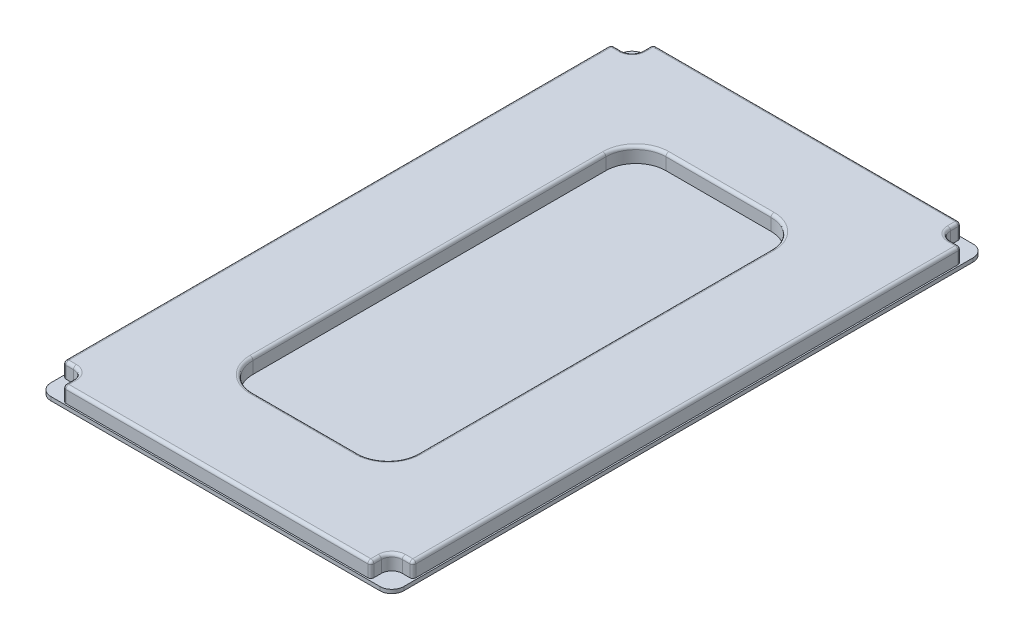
ISO-10303-21;
HEADER;
FILE_DESCRIPTION(('STEP AP214'),'2;1');
FILE_NAME('part.step','',(''),(''),'','','');
FILE_SCHEMA(('AUTOMOTIVE_DESIGN { 1 0 10303 214 1 1 1 1 }'));
ENDSEC;
DATA;
#1=APPLICATION_CONTEXT('core data for automotive mechanical design processes');
#2=APPLICATION_PROTOCOL_DEFINITION('international standard','automotive_design',2000,#1);
#3=PRODUCT_CONTEXT('',#1,'mechanical');
#4=PRODUCT('Part','Part','',(#3));
#5=PRODUCT_RELATED_PRODUCT_CATEGORY('part','',(#4));
#6=PRODUCT_DEFINITION_FORMATION('','',#4);
#7=PRODUCT_DEFINITION_CONTEXT('part definition',#1,'design');
#8=PRODUCT_DEFINITION('design','',#6,#7);
#9=PRODUCT_DEFINITION_SHAPE('','',#8);
#10=(LENGTH_UNIT() NAMED_UNIT(*) SI_UNIT(.MILLI.,.METRE.));
#11=(NAMED_UNIT(*) PLANE_ANGLE_UNIT() SI_UNIT($,.RADIAN.));
#12=(NAMED_UNIT(*) SI_UNIT($,.STERADIAN.) SOLID_ANGLE_UNIT());
#13=UNCERTAINTY_MEASURE_WITH_UNIT(LENGTH_MEASURE(1.E-05),#10,'distance_accuracy_value','');
#14=(GEOMETRIC_REPRESENTATION_CONTEXT(3) GLOBAL_UNCERTAINTY_ASSIGNED_CONTEXT((#13)) GLOBAL_UNIT_ASSIGNED_CONTEXT((#10,
#11,#12)) REPRESENTATION_CONTEXT('',''));
#15=CARTESIAN_POINT('',(0.,0.,0.));
#16=DIRECTION('',(0.,0.,1.));
#17=DIRECTION('',(1.,0.,0.));
#18=AXIS2_PLACEMENT_3D('',#15,#16,#17);
#19=CARTESIAN_POINT('',(2.54,3.96875,-2.54));
#20=DIRECTION('',(0.,-1.,0.));
#21=DIRECTION('',(0.,0.,-1.));
#22=AXIS2_PLACEMENT_3D('',#19,#20,#21);
#23=PLANE('',#22);
#24=CARTESIAN_POINT('',(26.19375,3.96875,-25.4));
#25=DIRECTION('',(0.,-1.,0.));
#26=DIRECTION('',(0.,0.,-1.));
#27=AXIS2_PLACEMENT_3D('',#24,#25,#26);
#28=CIRCLE('',#27,6.985);
#29=CARTESIAN_POINT('',(26.19375,3.96875,-18.415));
#30=VERTEX_POINT('',#29);
#31=CARTESIAN_POINT('',(19.20875,3.96875,-25.4));
#32=VERTEX_POINT('',#31);
#33=EDGE_CURVE('E570',#30,#32,#28,.T.);
#34=ORIENTED_EDGE('',*,*,#33,.T.);
#35=DIRECTION('',(0.,0.,1.));
#36=VECTOR('',#35,1.);
#37=CARTESIAN_POINT('',(19.20875,3.96875,-100.0125));
#38=LINE('',#37,#36);
#39=CARTESIAN_POINT('',(19.20875,3.96875,-100.0125));
#40=VERTEX_POINT('',#39);
#41=EDGE_CURVE('E569',#32,#40,#38,.F.);
#42=ORIENTED_EDGE('',*,*,#41,.T.);
#43=CARTESIAN_POINT('',(26.19375,3.96875,-100.0125));
#44=DIRECTION('',(0.,-1.,0.));
#45=DIRECTION('',(0.,0.,-1.));
#46=AXIS2_PLACEMENT_3D('',#43,#44,#45);
#47=CIRCLE('',#46,6.985);
#48=CARTESIAN_POINT('',(26.19375,3.96875,-106.9975));
#49=VERTEX_POINT('',#48);
#50=EDGE_CURVE('E553',#40,#49,#47,.T.);
#51=ORIENTED_EDGE('',*,*,#50,.T.);
#52=DIRECTION('',(-1.,0.,0.));
#53=VECTOR('',#52,1.);
#54=CARTESIAN_POINT('',(48.41875,3.96875,-106.9975));
#55=LINE('',#54,#53);
#56=CARTESIAN_POINT('',(48.41875,3.96875,-106.9975));
#57=VERTEX_POINT('',#56);
#58=EDGE_CURVE('E560',#49,#57,#55,.F.);
#59=ORIENTED_EDGE('',*,*,#58,.T.);
#60=CARTESIAN_POINT('',(48.41875,3.96875,-100.0125));
#61=DIRECTION('',(0.,-1.,0.));
#62=DIRECTION('',(0.,0.,-1.));
#63=AXIS2_PLACEMENT_3D('',#60,#61,#62);
#64=CIRCLE('',#63,6.985);
#65=CARTESIAN_POINT('',(55.40375,3.96875,-100.0125));
#66=VERTEX_POINT('',#65);
#67=EDGE_CURVE('E559',#57,#66,#64,.T.);
#68=ORIENTED_EDGE('',*,*,#67,.T.);
#69=DIRECTION('',(0.,0.,-1.));
#70=VECTOR('',#69,1.);
#71=CARTESIAN_POINT('',(55.40375,3.96875,-25.4));
#72=LINE('',#71,#70);
#73=CARTESIAN_POINT('',(55.40375,3.96875,-25.4));
#74=VERTEX_POINT('',#73);
#75=EDGE_CURVE('E561',#66,#74,#72,.F.);
#76=ORIENTED_EDGE('',*,*,#75,.T.);
#77=CARTESIAN_POINT('',(48.41875,3.96875,-25.4));
#78=DIRECTION('',(0.,-1.,0.));
#79=DIRECTION('',(0.,0.,-1.));
#80=AXIS2_PLACEMENT_3D('',#77,#78,#79);
#81=CIRCLE('',#80,6.985);
#82=CARTESIAN_POINT('',(48.41875,3.96875,-18.415));
#83=VERTEX_POINT('',#82);
#84=EDGE_CURVE('E564',#74,#83,#81,.T.);
#85=ORIENTED_EDGE('',*,*,#84,.T.);
#86=DIRECTION('',(1.,0.,0.));
#87=VECTOR('',#86,1.);
#88=CARTESIAN_POINT('',(26.19375,3.96875,-18.415));
#89=LINE('',#88,#87);
#90=EDGE_CURVE('E565',#83,#30,#89,.F.);
#91=ORIENTED_EDGE('',*,*,#90,.T.);
#92=EDGE_LOOP('',(#34,#42,#51,#59,#68,#76,#85,#91));
#93=FACE_BOUND('',#92,.T.);
#94=CARTESIAN_POINT('',(2.54,3.96875,-122.8725));
#95=DIRECTION('',(0.,-1.,0.));
#96=DIRECTION('',(0.,0.,-1.));
#97=AXIS2_PLACEMENT_3D('',#94,#95,#96);
#98=CIRCLE('',#97,2.8575);
#99=CARTESIAN_POINT('',(5.39750000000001,3.96875,-122.8725));
#100=VERTEX_POINT('',#99);
#101=CARTESIAN_POINT('',(2.54,3.96875,-120.015));
#102=VERTEX_POINT('',#101);
#103=EDGE_CURVE('E549',#100,#102,#98,.T.);
#104=ORIENTED_EDGE('',*,*,#103,.T.);
#105=DIRECTION('',(-1.,0.,0.));
#106=VECTOR('',#105,1.);
#107=CARTESIAN_POINT('',(2.54,3.96875,-120.015));
#108=LINE('',#107,#106);
#109=CARTESIAN_POINT('',(0.952499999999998,3.96875,-120.015));
#110=VERTEX_POINT('',#109);
#111=EDGE_CURVE('E555',#102,#110,#108,.T.);
#112=ORIENTED_EDGE('',*,*,#111,.T.);
#113=DIRECTION('',(0.,0.,1.));
#114=VECTOR('',#113,1.);
#115=CARTESIAN_POINT('',(0.952499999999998,3.96875,-2.54));
#116=LINE('',#115,#114);
#117=CARTESIAN_POINT('',(0.952499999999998,3.96875,-5.3975));
#118=VERTEX_POINT('',#117);
#119=EDGE_CURVE('E522',#110,#118,#116,.T.);
#120=ORIENTED_EDGE('',*,*,#119,.T.);
#121=DIRECTION('',(1.,0.,0.));
#122=VECTOR('',#121,1.);
#123=CARTESIAN_POINT('',(2.54,3.96875,-5.3975));
#124=LINE('',#123,#122);
#125=CARTESIAN_POINT('',(2.54,3.96875,-5.3975));
#126=VERTEX_POINT('',#125);
#127=EDGE_CURVE('E523',#118,#126,#124,.T.);
#128=ORIENTED_EDGE('',*,*,#127,.T.);
#129=CARTESIAN_POINT('',(2.54,3.96875,-2.54));
#130=DIRECTION('',(0.,-1.,0.));
#131=DIRECTION('',(0.,0.,-1.));
#132=AXIS2_PLACEMENT_3D('',#129,#130,#131);
#133=CIRCLE('',#132,2.8575);
#134=CARTESIAN_POINT('',(5.3975,3.96875,-2.54));
#135=VERTEX_POINT('',#134);
#136=EDGE_CURVE('E528',#126,#135,#133,.T.);
#137=ORIENTED_EDGE('',*,*,#136,.T.);
#138=DIRECTION('',(0.,0.,1.));
#139=VECTOR('',#138,1.);
#140=CARTESIAN_POINT('',(5.3975,3.96875,-2.54));
#141=LINE('',#140,#139);
#142=CARTESIAN_POINT('',(5.3975,3.96875,-0.952499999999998));
#143=VERTEX_POINT('',#142);
#144=EDGE_CURVE('E526',#135,#143,#141,.T.);
#145=ORIENTED_EDGE('',*,*,#144,.T.);
#146=DIRECTION('',(1.,0.,0.));
#147=VECTOR('',#146,1.);
#148=CARTESIAN_POINT('',(2.54,3.96875,-0.952499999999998));
#149=LINE('',#148,#147);
#150=CARTESIAN_POINT('',(69.215,3.96875,-0.952499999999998));
#151=VERTEX_POINT('',#150);
#152=EDGE_CURVE('E529',#143,#151,#149,.T.);
#153=ORIENTED_EDGE('',*,*,#152,.T.);
#154=DIRECTION('',(0.,0.,-1.));
#155=VECTOR('',#154,1.);
#156=CARTESIAN_POINT('',(69.215,3.96875,-2.54));
#157=LINE('',#156,#155);
#158=CARTESIAN_POINT('',(69.215,3.96875,-2.54));
#159=VERTEX_POINT('',#158);
#160=EDGE_CURVE('E535',#151,#159,#157,.T.);
#161=ORIENTED_EDGE('',*,*,#160,.T.);
#162=CARTESIAN_POINT('',(72.0725,3.96875,-2.54));
#163=DIRECTION('',(0.,-1.,0.));
#164=DIRECTION('',(0.,0.,-1.));
#165=AXIS2_PLACEMENT_3D('',#162,#163,#164);
#166=CIRCLE('',#165,2.8575);
#167=CARTESIAN_POINT('',(72.0725,3.96875,-5.3975));
#168=VERTEX_POINT('',#167);
#169=EDGE_CURVE('E534',#159,#168,#166,.T.);
#170=ORIENTED_EDGE('',*,*,#169,.T.);
#171=DIRECTION('',(1.,0.,0.));
#172=VECTOR('',#171,1.);
#173=CARTESIAN_POINT('',(2.54,3.96875,-5.3975));
#174=LINE('',#173,#172);
#175=CARTESIAN_POINT('',(73.66,3.96875,-5.3975));
#176=VERTEX_POINT('',#175);
#177=EDGE_CURVE('E536',#168,#176,#174,.T.);
#178=ORIENTED_EDGE('',*,*,#177,.T.);
#179=DIRECTION('',(0.,0.,-1.));
#180=VECTOR('',#179,1.);
#181=CARTESIAN_POINT('',(73.66,3.96875,-2.54));
#182=LINE('',#181,#180);
#183=CARTESIAN_POINT('',(73.66,3.96875,-120.015));
#184=VERTEX_POINT('',#183);
#185=EDGE_CURVE('E538',#176,#184,#182,.T.);
#186=ORIENTED_EDGE('',*,*,#185,.T.);
#187=DIRECTION('',(-1.,0.,0.));
#188=VECTOR('',#187,1.);
#189=CARTESIAN_POINT('',(2.54,3.96875,-120.015));
#190=LINE('',#189,#188);
#191=CARTESIAN_POINT('',(72.0725,3.96875,-120.015));
#192=VERTEX_POINT('',#191);
#193=EDGE_CURVE('E539',#184,#192,#190,.T.);
#194=ORIENTED_EDGE('',*,*,#193,.T.);
#195=CARTESIAN_POINT('',(72.0725,3.96875,-122.8725));
#196=DIRECTION('',(0.,-1.,0.));
#197=DIRECTION('',(0.,0.,-1.));
#198=AXIS2_PLACEMENT_3D('',#195,#196,#197);
#199=CIRCLE('',#198,2.8575);
#200=CARTESIAN_POINT('',(69.215,3.96875,-122.8725));
#201=VERTEX_POINT('',#200);
#202=EDGE_CURVE('E545',#192,#201,#199,.T.);
#203=ORIENTED_EDGE('',*,*,#202,.T.);
#204=DIRECTION('',(0.,0.,-1.));
#205=VECTOR('',#204,1.);
#206=CARTESIAN_POINT('',(69.215,3.96875,-2.54));
#207=LINE('',#206,#205);
#208=CARTESIAN_POINT('',(69.215,3.96875,-124.46));
#209=VERTEX_POINT('',#208);
#210=EDGE_CURVE('E542',#201,#209,#207,.T.);
#211=ORIENTED_EDGE('',*,*,#210,.T.);
#212=DIRECTION('',(-1.,0.,0.));
#213=VECTOR('',#212,1.);
#214=CARTESIAN_POINT('',(2.54,3.96875,-124.46));
#215=LINE('',#214,#213);
#216=CARTESIAN_POINT('',(5.3975,3.96875,-124.46));
#217=VERTEX_POINT('',#216);
#218=EDGE_CURVE('E546',#209,#217,#215,.T.);
#219=ORIENTED_EDGE('',*,*,#218,.T.);
#220=DIRECTION('',(0.,0.,1.));
#221=VECTOR('',#220,1.);
#222=CARTESIAN_POINT('',(5.39750000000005,3.96875,-2.54));
#223=LINE('',#222,#221);
#224=EDGE_CURVE('E547',#217,#100,#223,.T.);
#225=ORIENTED_EDGE('',*,*,#224,.T.);
#226=EDGE_LOOP('',(#104,#112,#120,#128,#137,#145,#153,#161,#170,#178,#186,#194,#203,#211,#219,#225));
#227=FACE_BOUND('',#226,.T.);
#228=ADVANCED_FACE('F56',(#93,#227),#23,.F.);
#229=CARTESIAN_POINT('',(2.54,0.79375,-2.54));
#230=DIRECTION('',(0.,-1.,0.));
#231=DIRECTION('',(0.,0.,-1.));
#232=AXIS2_PLACEMENT_3D('',#229,#230,#231);
#233=PLANE('',#232);
#234=DIRECTION('',(1.,0.,0.));
#235=VECTOR('',#234,1.);
#236=CARTESIAN_POINT('',(2.54,0.79375,-4.7625));
#237=LINE('',#236,#235);
#238=CARTESIAN_POINT('',(0.952499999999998,0.79375,-4.7625));
#239=VERTEX_POINT('',#238);
#240=CARTESIAN_POINT('',(2.54,0.79375,-4.7625));
#241=VERTEX_POINT('',#240);
#242=EDGE_CURVE('E448',#239,#241,#237,.T.);
#243=ORIENTED_EDGE('',*,*,#242,.F.);
#244=CARTESIAN_POINT('',(0.952499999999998,0.79375,-5.3975));
#245=DIRECTION('',(0.,-1.,0.));
#246=DIRECTION('',(0.,0.,-1.));
#247=AXIS2_PLACEMENT_3D('',#244,#245,#246);
#248=CIRCLE('',#247,0.635);
#249=CARTESIAN_POINT('',(0.317499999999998,0.79375,-5.3975));
#250=VERTEX_POINT('',#249);
#251=EDGE_CURVE('E481',#239,#250,#248,.T.);
#252=ORIENTED_EDGE('',*,*,#251,.T.);
#253=DIRECTION('',(0.,0.,1.));
#254=VECTOR('',#253,1.);
#255=CARTESIAN_POINT('',(0.317499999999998,0.79375,-120.65));
#256=LINE('',#255,#254);
#257=CARTESIAN_POINT('',(0.317499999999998,0.79375,-120.015));
#258=VERTEX_POINT('',#257);
#259=EDGE_CURVE('E444',#258,#250,#256,.T.);
#260=ORIENTED_EDGE('',*,*,#259,.F.);
#261=CARTESIAN_POINT('',(0.952499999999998,0.79375,-120.015));
#262=DIRECTION('',(0.,-1.,0.));
#263=DIRECTION('',(0.,0.,-1.));
#264=AXIS2_PLACEMENT_3D('',#261,#262,#263);
#265=CIRCLE('',#264,0.635);
#266=CARTESIAN_POINT('',(0.952499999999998,0.79375,-120.65));
#267=VERTEX_POINT('',#266);
#268=EDGE_CURVE('E468',#258,#267,#265,.T.);
#269=ORIENTED_EDGE('',*,*,#268,.T.);
#270=DIRECTION('',(-1.,0.,0.));
#271=VECTOR('',#270,1.);
#272=CARTESIAN_POINT('',(2.54,0.79375,-120.65));
#273=LINE('',#272,#271);
#274=CARTESIAN_POINT('',(2.54,0.79375,-120.65));
#275=VERTEX_POINT('',#274);
#276=EDGE_CURVE('E439',#275,#267,#273,.T.);
#277=ORIENTED_EDGE('',*,*,#276,.F.);
#278=CARTESIAN_POINT('',(2.54,0.79375,-122.8725));
#279=DIRECTION('',(0.,-1.,0.));
#280=DIRECTION('',(0.,0.,1.));
#281=AXIS2_PLACEMENT_3D('',#278,#279,#280);
#282=CIRCLE('',#281,2.2225);
#283=CARTESIAN_POINT('',(4.7625,0.79375,-122.8725));
#284=VERTEX_POINT('',#283);
#285=EDGE_CURVE('E440',#284,#275,#282,.T.);
#286=ORIENTED_EDGE('',*,*,#285,.F.);
#287=DIRECTION('',(0.,0.,1.));
#288=VECTOR('',#287,1.);
#289=CARTESIAN_POINT('',(4.76250000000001,0.79375,-122.8725));
#290=LINE('',#289,#288);
#291=CARTESIAN_POINT('',(4.7625,0.79375,-124.46));
#292=VERTEX_POINT('',#291);
#293=EDGE_CURVE('E432',#292,#284,#290,.T.);
#294=ORIENTED_EDGE('',*,*,#293,.F.);
#295=CARTESIAN_POINT('',(5.3975,0.79375,-124.46));
#296=DIRECTION('',(0.,-1.,0.));
#297=DIRECTION('',(0.,0.,-1.));
#298=AXIS2_PLACEMENT_3D('',#295,#296,#297);
#299=CIRCLE('',#298,0.635);
#300=CARTESIAN_POINT('',(5.3975,0.79375,-125.095));
#301=VERTEX_POINT('',#300);
#302=EDGE_CURVE('E467',#292,#301,#299,.T.);
#303=ORIENTED_EDGE('',*,*,#302,.T.);
#304=DIRECTION('',(-1.,0.,0.));
#305=VECTOR('',#304,1.);
#306=CARTESIAN_POINT('',(69.85,0.79375,-125.095));
#307=LINE('',#306,#305);
#308=CARTESIAN_POINT('',(69.215,0.79375,-125.095));
#309=VERTEX_POINT('',#308);
#310=EDGE_CURVE('E431',#309,#301,#307,.T.);
#311=ORIENTED_EDGE('',*,*,#310,.F.);
#312=CARTESIAN_POINT('',(69.215,0.79375,-124.46));
#313=DIRECTION('',(0.,-1.,0.));
#314=DIRECTION('',(0.,0.,-1.));
#315=AXIS2_PLACEMENT_3D('',#312,#313,#314);
#316=CIRCLE('',#315,0.635);
#317=CARTESIAN_POINT('',(69.85,0.79375,-124.46));
#318=VERTEX_POINT('',#317);
#319=EDGE_CURVE('E473',#309,#318,#316,.T.);
#320=ORIENTED_EDGE('',*,*,#319,.T.);
#321=DIRECTION('',(0.,0.,-1.));
#322=VECTOR('',#321,1.);
#323=CARTESIAN_POINT('',(69.85,0.79375,-122.8725));
#324=LINE('',#323,#322);
#325=CARTESIAN_POINT('',(69.85,0.79375,-122.8725));
#326=VERTEX_POINT('',#325);
#327=EDGE_CURVE('E428',#326,#318,#324,.T.);
#328=ORIENTED_EDGE('',*,*,#327,.F.);
#329=CARTESIAN_POINT('',(72.0725,0.79375,-122.8725));
#330=DIRECTION('',(0.,-1.,0.));
#331=DIRECTION('',(0.,0.,-1.));
#332=AXIS2_PLACEMENT_3D('',#329,#330,#331);
#333=CIRCLE('',#332,2.2225);
#334=CARTESIAN_POINT('',(72.0725,0.79375,-120.65));
#335=VERTEX_POINT('',#334);
#336=EDGE_CURVE('E422',#335,#326,#333,.T.);
#337=ORIENTED_EDGE('',*,*,#336,.F.);
#338=DIRECTION('',(-1.,0.,0.));
#339=VECTOR('',#338,1.);
#340=CARTESIAN_POINT('',(72.0725,0.79375,-120.65));
#341=LINE('',#340,#339);
#342=CARTESIAN_POINT('',(73.66,0.79375,-120.65));
#343=VERTEX_POINT('',#342);
#344=EDGE_CURVE('E425',#343,#335,#341,.T.);
#345=ORIENTED_EDGE('',*,*,#344,.F.);
#346=CARTESIAN_POINT('',(73.66,0.79375,-120.015));
#347=DIRECTION('',(0.,-1.,0.));
#348=DIRECTION('',(0.,0.,-1.));
#349=AXIS2_PLACEMENT_3D('',#346,#347,#348);
#350=CIRCLE('',#349,0.635);
#351=CARTESIAN_POINT('',(74.295,0.79375,-120.015));
#352=VERTEX_POINT('',#351);
#353=EDGE_CURVE('E471',#343,#352,#350,.T.);
#354=ORIENTED_EDGE('',*,*,#353,.T.);
#355=DIRECTION('',(0.,0.,-1.));
#356=VECTOR('',#355,1.);
#357=CARTESIAN_POINT('',(74.295,0.79375,-4.7625));
#358=LINE('',#357,#356);
#359=CARTESIAN_POINT('',(74.295,0.79375,-5.3975));
#360=VERTEX_POINT('',#359);
#361=EDGE_CURVE('E420',#360,#352,#358,.T.);
#362=ORIENTED_EDGE('',*,*,#361,.F.);
#363=CARTESIAN_POINT('',(73.66,0.79375,-5.3975));
#364=DIRECTION('',(0.,-1.,0.));
#365=DIRECTION('',(0.,0.,-1.));
#366=AXIS2_PLACEMENT_3D('',#363,#364,#365);
#367=CIRCLE('',#366,0.635);
#368=CARTESIAN_POINT('',(73.66,0.79375,-4.7625));
#369=VERTEX_POINT('',#368);
#370=EDGE_CURVE('E474',#360,#369,#367,.T.);
#371=ORIENTED_EDGE('',*,*,#370,.T.);
#372=DIRECTION('',(1.,0.,0.));
#373=VECTOR('',#372,1.);
#374=CARTESIAN_POINT('',(72.0725,0.79375,-4.7625));
#375=LINE('',#374,#373);
#376=CARTESIAN_POINT('',(72.0725,0.79375,-4.7625));
#377=VERTEX_POINT('',#376);
#378=EDGE_CURVE('E418',#377,#369,#375,.T.);
#379=ORIENTED_EDGE('',*,*,#378,.F.);
#380=CARTESIAN_POINT('',(72.0725,0.79375,-2.54));
#381=DIRECTION('',(0.,-1.,0.));
#382=DIRECTION('',(0.,0.,1.));
#383=AXIS2_PLACEMENT_3D('',#380,#381,#382);
#384=CIRCLE('',#383,2.2225);
#385=CARTESIAN_POINT('',(69.85,0.79375,-2.54));
#386=VERTEX_POINT('',#385);
#387=EDGE_CURVE('E414',#386,#377,#384,.T.);
#388=ORIENTED_EDGE('',*,*,#387,.F.);
#389=DIRECTION('',(0.,0.,-1.));
#390=VECTOR('',#389,1.);
#391=CARTESIAN_POINT('',(69.85,0.79375,-2.54));
#392=LINE('',#391,#390);
#393=CARTESIAN_POINT('',(69.85,0.79375,-0.952499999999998));
#394=VERTEX_POINT('',#393);
#395=EDGE_CURVE('E410',#394,#386,#392,.T.);
#396=ORIENTED_EDGE('',*,*,#395,.F.);
#397=CARTESIAN_POINT('',(69.215,0.79375,-0.952499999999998));
#398=DIRECTION('',(0.,-1.,0.));
#399=DIRECTION('',(0.,0.,-1.));
#400=AXIS2_PLACEMENT_3D('',#397,#398,#399);
#401=CIRCLE('',#400,0.635);
#402=CARTESIAN_POINT('',(69.215,0.79375,-0.317499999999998));
#403=VERTEX_POINT('',#402);
#404=EDGE_CURVE('E480',#394,#403,#401,.T.);
#405=ORIENTED_EDGE('',*,*,#404,.T.);
#406=DIRECTION('',(1.,0.,0.));
#407=VECTOR('',#406,1.);
#408=CARTESIAN_POINT('',(4.7625,0.79375,-0.317499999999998));
#409=LINE('',#408,#407);
#410=CARTESIAN_POINT('',(5.3975,0.79375,-0.317499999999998));
#411=VERTEX_POINT('',#410);
#412=EDGE_CURVE('E407',#411,#403,#409,.T.);
#413=ORIENTED_EDGE('',*,*,#412,.F.);
#414=CARTESIAN_POINT('',(5.3975,0.79375,-0.952499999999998));
#415=DIRECTION('',(0.,-1.,0.));
#416=DIRECTION('',(0.,0.,-1.));
#417=AXIS2_PLACEMENT_3D('',#414,#415,#416);
#418=CIRCLE('',#417,0.635);
#419=CARTESIAN_POINT('',(4.7625,0.79375,-0.952499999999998));
#420=VERTEX_POINT('',#419);
#421=EDGE_CURVE('E479',#411,#420,#418,.T.);
#422=ORIENTED_EDGE('',*,*,#421,.T.);
#423=DIRECTION('',(0.,0.,1.));
#424=VECTOR('',#423,1.);
#425=CARTESIAN_POINT('',(4.76250000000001,0.79375,-2.54));
#426=LINE('',#425,#424);
#427=CARTESIAN_POINT('',(4.76250000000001,0.79375,-2.54));
#428=VERTEX_POINT('',#427);
#429=EDGE_CURVE('E404',#428,#420,#426,.T.);
#430=ORIENTED_EDGE('',*,*,#429,.F.);
#431=CARTESIAN_POINT('',(2.54,0.79375,-2.54));
#432=DIRECTION('',(0.,-1.,0.));
#433=DIRECTION('',(0.,0.,-1.));
#434=AXIS2_PLACEMENT_3D('',#431,#432,#433);
#435=CIRCLE('',#434,2.2225);
#436=EDGE_CURVE('E353',#241,#428,#435,.T.);
#437=ORIENTED_EDGE('',*,*,#436,.F.);
#438=EDGE_LOOP('',(#243,#252,#260,#269,#277,#286,#294,#303,#311,#320,#328,#337,#345,#354,#362,
#371,#379,#388,#396,#405,#413,#422,#430,#437));
#439=FACE_BOUND('',#438,.T.);
#440=DIRECTION('',(-1.,0.,0.));
#441=VECTOR('',#440,1.);
#442=CARTESIAN_POINT('',(26.19375,0.79375,-106.3625));
#443=LINE('',#442,#441);
#444=CARTESIAN_POINT('',(48.41875,0.79375,-106.3625));
#445=VERTEX_POINT('',#444);
#446=CARTESIAN_POINT('',(26.19375,0.79375,-106.3625));
#447=VERTEX_POINT('',#446);
#448=EDGE_CURVE('E369',#445,#447,#443,.T.);
#449=ORIENTED_EDGE('',*,*,#448,.T.);
#450=CARTESIAN_POINT('',(26.19375,0.79375,-100.0125));
#451=DIRECTION('',(0.,1.,0.));
#452=DIRECTION('',(0.,0.,-1.));
#453=AXIS2_PLACEMENT_3D('',#450,#451,#452);
#454=CIRCLE('',#453,6.35);
#455=CARTESIAN_POINT('',(19.84375,0.79375,-100.0125));
#456=VERTEX_POINT('',#455);
#457=EDGE_CURVE('E350',#447,#456,#454,.T.);
#458=ORIENTED_EDGE('',*,*,#457,.T.);
#459=DIRECTION('',(0.,0.,1.));
#460=VECTOR('',#459,1.);
#461=CARTESIAN_POINT('',(19.84375,0.79375,-25.4));
#462=LINE('',#461,#460);
#463=CARTESIAN_POINT('',(19.84375,0.79375,-25.4));
#464=VERTEX_POINT('',#463);
#465=EDGE_CURVE('E359',#456,#464,#462,.T.);
#466=ORIENTED_EDGE('',*,*,#465,.T.);
#467=CARTESIAN_POINT('',(26.19375,0.79375,-25.4));
#468=DIRECTION('',(0.,1.,0.));
#469=DIRECTION('',(0.,0.,-1.));
#470=AXIS2_PLACEMENT_3D('',#467,#468,#469);
#471=CIRCLE('',#470,6.35);
#472=CARTESIAN_POINT('',(26.19375,0.79375,-19.05));
#473=VERTEX_POINT('',#472);
#474=EDGE_CURVE('E365',#464,#473,#471,.T.);
#475=ORIENTED_EDGE('',*,*,#474,.T.);
#476=DIRECTION('',(1.,0.,0.));
#477=VECTOR('',#476,1.);
#478=CARTESIAN_POINT('',(26.19375,0.79375,-19.05));
#479=LINE('',#478,#477);
#480=CARTESIAN_POINT('',(48.41875,0.79375,-19.05));
#481=VERTEX_POINT('',#480);
#482=EDGE_CURVE('E380',#473,#481,#479,.T.);
#483=ORIENTED_EDGE('',*,*,#482,.T.);
#484=CARTESIAN_POINT('',(48.41875,0.79375,-25.4));
#485=DIRECTION('',(0.,1.,0.));
#486=DIRECTION('',(0.,0.,1.));
#487=AXIS2_PLACEMENT_3D('',#484,#485,#486);
#488=CIRCLE('',#487,6.35);
#489=CARTESIAN_POINT('',(54.76875,0.79375,-25.4));
#490=VERTEX_POINT('',#489);
#491=EDGE_CURVE('E379',#481,#490,#488,.T.);
#492=ORIENTED_EDGE('',*,*,#491,.T.);
#493=DIRECTION('',(0.,0.,-1.));
#494=VECTOR('',#493,1.);
#495=CARTESIAN_POINT('',(54.76875,0.79375,-25.4));
#496=LINE('',#495,#494);
#497=CARTESIAN_POINT('',(54.76875,0.79375,-100.0125));
#498=VERTEX_POINT('',#497);
#499=EDGE_CURVE('E382',#490,#498,#496,.T.);
#500=ORIENTED_EDGE('',*,*,#499,.T.);
#501=CARTESIAN_POINT('',(48.41875,0.79375,-100.0125));
#502=DIRECTION('',(0.,1.,0.));
#503=DIRECTION('',(0.,0.,-1.));
#504=AXIS2_PLACEMENT_3D('',#501,#502,#503);
#505=CIRCLE('',#504,6.35);
#506=EDGE_CURVE('E387',#498,#445,#505,.T.);
#507=ORIENTED_EDGE('',*,*,#506,.T.);
#508=EDGE_LOOP('',(#449,#458,#466,#475,#483,#492,#500,#507));
#509=FACE_BOUND('',#508,.T.);
#510=ADVANCED_FACE('F368',(#439,#509),#233,.T.);
#511=CARTESIAN_POINT('',(2.54,3.96875,-2.54));
#512=DIRECTION('',(0.,-1.,0.));
#513=DIRECTION('',(0.,0.,-1.));
#514=AXIS2_PLACEMENT_3D('',#511,#512,#513);
#515=CYLINDRICAL_SURFACE('',#514,2.2225);
#516=DIRECTION('',(0.,-1.,0.));
#517=VECTOR('',#516,1.);
#518=CARTESIAN_POINT('',(4.76250000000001,3.96875,-2.54));
#519=LINE('',#518,#517);
#520=CARTESIAN_POINT('',(4.76250000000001,3.33375,-2.54));
#521=VERTEX_POINT('',#520);
#522=EDGE_CURVE('E464',#521,#428,#519,.T.);
#523=ORIENTED_EDGE('',*,*,#522,.F.);
#524=CARTESIAN_POINT('',(2.54,3.33375,-2.54));
#525=DIRECTION('',(0.,-1.,0.));
#526=DIRECTION('',(0.,0.,-1.));
#527=AXIS2_PLACEMENT_3D('',#524,#525,#526);
#528=CIRCLE('',#527,2.2225);
#529=CARTESIAN_POINT('',(2.54,3.33375,-4.7625));
#530=VERTEX_POINT('',#529);
#531=EDGE_CURVE('E626',#521,#530,#528,.F.);
#532=ORIENTED_EDGE('',*,*,#531,.T.);
#533=DIRECTION('',(0.,-1.,0.));
#534=VECTOR('',#533,1.);
#535=CARTESIAN_POINT('',(2.54,3.96875,-4.7625));
#536=LINE('',#535,#534);
#537=EDGE_CURVE('E449',#530,#241,#536,.T.);
#538=ORIENTED_EDGE('',*,*,#537,.T.);
#539=ORIENTED_EDGE('',*,*,#436,.T.);
#540=EDGE_LOOP('',(#523,#532,#538,#539));
#541=FACE_BOUND('',#540,.T.);
#542=ADVANCED_FACE('F808',(#541),#515,.F.);
#543=CARTESIAN_POINT('',(4.76250000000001,3.96875,-2.54));
#544=DIRECTION('',(1.,0.,0.));
#545=DIRECTION('',(0.,0.,-1.));
#546=AXIS2_PLACEMENT_3D('',#543,#544,#545);
#547=PLANE('',#546);
#548=DIRECTION('',(0.,-1.,0.));
#549=VECTOR('',#548,1.);
#550=CARTESIAN_POINT('',(4.7625,3.96875,-0.952499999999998));
#551=LINE('',#550,#549);
#552=CARTESIAN_POINT('',(4.7625,3.33375,-0.952499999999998));
#553=VERTEX_POINT('',#552);
#554=EDGE_CURVE('E495',#420,#553,#551,.F.);
#555=ORIENTED_EDGE('',*,*,#554,.T.);
#556=DIRECTION('',(0.,0.,1.));
#557=VECTOR('',#556,1.);
#558=CARTESIAN_POINT('',(4.76250000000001,3.33375,-2.54));
#559=LINE('',#558,#557);
#560=EDGE_CURVE('E624',#553,#521,#559,.F.);
#561=ORIENTED_EDGE('',*,*,#560,.T.);
#562=ORIENTED_EDGE('',*,*,#522,.T.);
#563=ORIENTED_EDGE('',*,*,#429,.T.);
#564=EDGE_LOOP('',(#555,#561,#562,#563));
#565=FACE_BOUND('',#564,.T.);
#566=ADVANCED_FACE('F800',(#565),#547,.F.);
#567=CARTESIAN_POINT('',(4.7625,3.96875,-0.317499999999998));
#568=DIRECTION('',(0.,0.,-1.));
#569=DIRECTION('',(-1.,0.,0.));
#570=AXIS2_PLACEMENT_3D('',#567,#568,#569);
#571=PLANE('',#570);
#572=DIRECTION('',(0.,-1.,0.));
#573=VECTOR('',#572,1.);
#574=CARTESIAN_POINT('',(69.215,3.96875,-0.317499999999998));
#575=LINE('',#574,#573);
#576=CARTESIAN_POINT('',(69.215,3.33375,-0.317499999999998));
#577=VERTEX_POINT('',#576);
#578=EDGE_CURVE('E490',#403,#577,#575,.F.);
#579=ORIENTED_EDGE('',*,*,#578,.T.);
#580=DIRECTION('',(1.,0.,0.));
#581=VECTOR('',#580,1.);
#582=CARTESIAN_POINT('',(4.7625,3.33375,-0.317499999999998));
#583=LINE('',#582,#581);
#584=CARTESIAN_POINT('',(5.3975,3.33375,-0.317499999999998));
#585=VERTEX_POINT('',#584);
#586=EDGE_CURVE('E620',#577,#585,#583,.F.);
#587=ORIENTED_EDGE('',*,*,#586,.T.);
#588=DIRECTION('',(0.,-1.,0.));
#589=VECTOR('',#588,1.);
#590=CARTESIAN_POINT('',(5.3975,3.96875,-0.317499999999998));
#591=LINE('',#590,#589);
#592=EDGE_CURVE('E489',#585,#411,#591,.T.);
#593=ORIENTED_EDGE('',*,*,#592,.T.);
#594=ORIENTED_EDGE('',*,*,#412,.T.);
#595=EDGE_LOOP('',(#579,#587,#593,#594));
#596=FACE_BOUND('',#595,.T.);
#597=ADVANCED_FACE('F779',(#596),#571,.F.);
#598=CARTESIAN_POINT('',(69.85,3.96875,-2.54));
#599=DIRECTION('',(-1.,0.,0.));
#600=DIRECTION('',(0.,0.,1.));
#601=AXIS2_PLACEMENT_3D('',#598,#599,#600);
#602=PLANE('',#601);
#603=DIRECTION('',(0.,-1.,0.));
#604=VECTOR('',#603,1.);
#605=CARTESIAN_POINT('',(69.85,3.96875,-2.54));
#606=LINE('',#605,#604);
#607=CARTESIAN_POINT('',(69.85,3.33375,-2.54));
#608=VERTEX_POINT('',#607);
#609=EDGE_CURVE('E461',#608,#386,#606,.T.);
#610=ORIENTED_EDGE('',*,*,#609,.F.);
#611=DIRECTION('',(0.,0.,-1.));
#612=VECTOR('',#611,1.);
#613=CARTESIAN_POINT('',(69.85,3.33375,-2.54));
#614=LINE('',#613,#612);
#615=CARTESIAN_POINT('',(69.85,3.33375,-0.952499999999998));
#616=VERTEX_POINT('',#615);
#617=EDGE_CURVE('E616',#608,#616,#614,.F.);
#618=ORIENTED_EDGE('',*,*,#617,.T.);
#619=DIRECTION('',(0.,-1.,0.));
#620=VECTOR('',#619,1.);
#621=CARTESIAN_POINT('',(69.85,3.96875,-0.952499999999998));
#622=LINE('',#621,#620);
#623=EDGE_CURVE('E494',#616,#394,#622,.T.);
#624=ORIENTED_EDGE('',*,*,#623,.T.);
#625=ORIENTED_EDGE('',*,*,#395,.T.);
#626=EDGE_LOOP('',(#610,#618,#624,#625));
#627=FACE_BOUND('',#626,.T.);
#628=ADVANCED_FACE('F775',(#627),#602,.F.);
#629=CARTESIAN_POINT('',(72.0725,3.96875,-2.54));
#630=DIRECTION('',(0.,-1.,0.));
#631=DIRECTION('',(0.,0.,-1.));
#632=AXIS2_PLACEMENT_3D('',#629,#630,#631);
#633=CYLINDRICAL_SURFACE('',#632,2.2225);
#634=DIRECTION('',(0.,-1.,0.));
#635=VECTOR('',#634,1.);
#636=CARTESIAN_POINT('',(72.0725,3.96875,-4.7625));
#637=LINE('',#636,#635);
#638=CARTESIAN_POINT('',(72.0725,3.33375,-4.7625));
#639=VERTEX_POINT('',#638);
#640=EDGE_CURVE('E459',#639,#377,#637,.T.);
#641=ORIENTED_EDGE('',*,*,#640,.F.);
#642=CARTESIAN_POINT('',(72.0725,3.33375,-2.54));
#643=DIRECTION('',(0.,-1.,0.));
#644=DIRECTION('',(0.,0.,-1.));
#645=AXIS2_PLACEMENT_3D('',#642,#643,#644);
#646=CIRCLE('',#645,2.2225);
#647=EDGE_CURVE('E614',#639,#608,#646,.F.);
#648=ORIENTED_EDGE('',*,*,#647,.T.);
#649=ORIENTED_EDGE('',*,*,#609,.T.);
#650=ORIENTED_EDGE('',*,*,#387,.T.);
#651=EDGE_LOOP('',(#641,#648,#649,#650));
#652=FACE_BOUND('',#651,.T.);
#653=ADVANCED_FACE('F769',(#652),#633,.F.);
#654=CARTESIAN_POINT('',(72.0725,3.96875,-4.7625));
#655=DIRECTION('',(0.,0.,-1.));
#656=DIRECTION('',(-1.,0.,0.));
#657=AXIS2_PLACEMENT_3D('',#654,#655,#656);
#658=PLANE('',#657);
#659=DIRECTION('',(0.,-1.,0.));
#660=VECTOR('',#659,1.);
#661=CARTESIAN_POINT('',(73.66,3.96875,-4.7625));
#662=LINE('',#661,#660);
#663=CARTESIAN_POINT('',(73.66,3.33375,-4.7625));
#664=VERTEX_POINT('',#663);
#665=EDGE_CURVE('E505',#369,#664,#662,.F.);
#666=ORIENTED_EDGE('',*,*,#665,.T.);
#667=DIRECTION('',(1.,0.,0.));
#668=VECTOR('',#667,1.);
#669=CARTESIAN_POINT('',(72.0725,3.33375,-4.7625));
#670=LINE('',#669,#668);
#671=EDGE_CURVE('E615',#664,#639,#670,.F.);
#672=ORIENTED_EDGE('',*,*,#671,.T.);
#673=ORIENTED_EDGE('',*,*,#640,.T.);
#674=ORIENTED_EDGE('',*,*,#378,.T.);
#675=EDGE_LOOP('',(#666,#672,#673,#674));
#676=FACE_BOUND('',#675,.T.);
#677=ADVANCED_FACE('F735',(#676),#658,.F.);
#678=CARTESIAN_POINT('',(74.295,3.96875,-4.7625));
#679=DIRECTION('',(-1.,0.,0.));
#680=DIRECTION('',(0.,0.,1.));
#681=AXIS2_PLACEMENT_3D('',#678,#679,#680);
#682=PLANE('',#681);
#683=DIRECTION('',(0.,-1.,0.));
#684=VECTOR('',#683,1.);
#685=CARTESIAN_POINT('',(74.295,3.96875,-120.015));
#686=LINE('',#685,#684);
#687=CARTESIAN_POINT('',(74.295,3.33375,-120.015));
#688=VERTEX_POINT('',#687);
#689=EDGE_CURVE('E500',#352,#688,#686,.F.);
#690=ORIENTED_EDGE('',*,*,#689,.T.);
#691=DIRECTION('',(0.,0.,-1.));
#692=VECTOR('',#691,1.);
#693=CARTESIAN_POINT('',(74.295,3.33375,-4.7625));
#694=LINE('',#693,#692);
#695=CARTESIAN_POINT('',(74.295,3.33375,-5.3975));
#696=VERTEX_POINT('',#695);
#697=EDGE_CURVE('E609',#688,#696,#694,.F.);
#698=ORIENTED_EDGE('',*,*,#697,.T.);
#699=DIRECTION('',(0.,-1.,0.));
#700=VECTOR('',#699,1.);
#701=CARTESIAN_POINT('',(74.295,3.96875,-5.3975));
#702=LINE('',#701,#700);
#703=EDGE_CURVE('E498',#696,#360,#702,.T.);
#704=ORIENTED_EDGE('',*,*,#703,.T.);
#705=ORIENTED_EDGE('',*,*,#361,.T.);
#706=EDGE_LOOP('',(#690,#698,#704,#705));
#707=FACE_BOUND('',#706,.T.);
#708=ADVANCED_FACE('F743',(#707),#682,.F.);
#709=CARTESIAN_POINT('',(72.0725,3.96875,-120.65));
#710=DIRECTION('',(0.,0.,1.));
#711=DIRECTION('',(1.,0.,0.));
#712=AXIS2_PLACEMENT_3D('',#709,#710,#711);
#713=PLANE('',#712);
#714=DIRECTION('',(0.,-1.,0.));
#715=VECTOR('',#714,1.);
#716=CARTESIAN_POINT('',(72.0725,3.96875,-120.65));
#717=LINE('',#716,#715);
#718=CARTESIAN_POINT('',(72.0725,3.33375,-120.65));
#719=VERTEX_POINT('',#718);
#720=EDGE_CURVE('E460',#719,#335,#717,.T.);
#721=ORIENTED_EDGE('',*,*,#720,.F.);
#722=DIRECTION('',(-1.,0.,0.));
#723=VECTOR('',#722,1.);
#724=CARTESIAN_POINT('',(72.0725,3.33375,-120.65));
#725=LINE('',#724,#723);
#726=CARTESIAN_POINT('',(73.66,3.33375,-120.65));
#727=VERTEX_POINT('',#726);
#728=EDGE_CURVE('E603',#719,#727,#725,.F.);
#729=ORIENTED_EDGE('',*,*,#728,.T.);
#730=DIRECTION('',(0.,-1.,0.));
#731=VECTOR('',#730,1.);
#732=CARTESIAN_POINT('',(73.66,3.96875,-120.65));
#733=LINE('',#732,#731);
#734=EDGE_CURVE('E502',#727,#343,#733,.T.);
#735=ORIENTED_EDGE('',*,*,#734,.T.);
#736=ORIENTED_EDGE('',*,*,#344,.T.);
#737=EDGE_LOOP('',(#721,#729,#735,#736));
#738=FACE_BOUND('',#737,.T.);
#739=ADVANCED_FACE('F941',(#738),#713,.F.);
#740=CARTESIAN_POINT('',(72.0725,3.96875,-122.8725));
#741=DIRECTION('',(0.,-1.,0.));
#742=DIRECTION('',(0.,0.,-1.));
#743=AXIS2_PLACEMENT_3D('',#740,#741,#742);
#744=CYLINDRICAL_SURFACE('',#743,2.2225);
#745=DIRECTION('',(0.,-1.,0.));
#746=VECTOR('',#745,1.);
#747=CARTESIAN_POINT('',(69.85,3.96875,-122.8725));
#748=LINE('',#747,#746);
#749=CARTESIAN_POINT('',(69.85,3.33375,-122.8725));
#750=VERTEX_POINT('',#749);
#751=EDGE_CURVE('E455',#750,#326,#748,.T.);
#752=ORIENTED_EDGE('',*,*,#751,.F.);
#753=CARTESIAN_POINT('',(72.0725,3.33375,-122.8725));
#754=DIRECTION('',(0.,-1.,0.));
#755=DIRECTION('',(0.,0.,-1.));
#756=AXIS2_PLACEMENT_3D('',#753,#754,#755);
#757=CIRCLE('',#756,2.2225);
#758=EDGE_CURVE('E605',#750,#719,#757,.F.);
#759=ORIENTED_EDGE('',*,*,#758,.T.);
#760=ORIENTED_EDGE('',*,*,#720,.T.);
#761=ORIENTED_EDGE('',*,*,#336,.T.);
#762=EDGE_LOOP('',(#752,#759,#760,#761));
#763=FACE_BOUND('',#762,.T.);
#764=ADVANCED_FACE('F898',(#763),#744,.F.);
#765=CARTESIAN_POINT('',(69.85,3.96875,-122.8725));
#766=DIRECTION('',(-1.,0.,0.));
#767=DIRECTION('',(0.,0.,1.));
#768=AXIS2_PLACEMENT_3D('',#765,#766,#767);
#769=PLANE('',#768);
#770=DIRECTION('',(0.,-1.,0.));
#771=VECTOR('',#770,1.);
#772=CARTESIAN_POINT('',(69.85,3.96875,-124.46));
#773=LINE('',#772,#771);
#774=CARTESIAN_POINT('',(69.85,3.33375,-124.46));
#775=VERTEX_POINT('',#774);
#776=EDGE_CURVE('E515',#318,#775,#773,.F.);
#777=ORIENTED_EDGE('',*,*,#776,.T.);
#778=DIRECTION('',(0.,0.,-1.));
#779=VECTOR('',#778,1.);
#780=CARTESIAN_POINT('',(69.85,3.33375,-122.8725));
#781=LINE('',#780,#779);
#782=EDGE_CURVE('E599',#775,#750,#781,.F.);
#783=ORIENTED_EDGE('',*,*,#782,.T.);
#784=ORIENTED_EDGE('',*,*,#751,.T.);
#785=ORIENTED_EDGE('',*,*,#327,.T.);
#786=EDGE_LOOP('',(#777,#783,#784,#785));
#787=FACE_BOUND('',#786,.T.);
#788=ADVANCED_FACE('F900',(#787),#769,.F.);
#789=CARTESIAN_POINT('',(69.85,3.96875,-125.095));
#790=DIRECTION('',(0.,0.,1.));
#791=DIRECTION('',(1.,0.,0.));
#792=AXIS2_PLACEMENT_3D('',#789,#790,#791);
#793=PLANE('',#792);
#794=DIRECTION('',(0.,-1.,0.));
#795=VECTOR('',#794,1.);
#796=CARTESIAN_POINT('',(5.3975,3.96875,-125.095));
#797=LINE('',#796,#795);
#798=CARTESIAN_POINT('',(5.3975,3.33375,-125.095));
#799=VERTEX_POINT('',#798);
#800=EDGE_CURVE('E507',#301,#799,#797,.F.);
#801=ORIENTED_EDGE('',*,*,#800,.T.);
#802=DIRECTION('',(-1.,0.,0.));
#803=VECTOR('',#802,1.);
#804=CARTESIAN_POINT('',(69.85,3.33375,-125.095));
#805=LINE('',#804,#803);
#806=CARTESIAN_POINT('',(69.215,3.33375,-125.095));
#807=VERTEX_POINT('',#806);
#808=EDGE_CURVE('E596',#799,#807,#805,.F.);
#809=ORIENTED_EDGE('',*,*,#808,.T.);
#810=DIRECTION('',(0.,-1.,0.));
#811=VECTOR('',#810,1.);
#812=CARTESIAN_POINT('',(69.215,3.96875,-125.095));
#813=LINE('',#812,#811);
#814=EDGE_CURVE('E510',#807,#309,#813,.T.);
#815=ORIENTED_EDGE('',*,*,#814,.T.);
#816=ORIENTED_EDGE('',*,*,#310,.T.);
#817=EDGE_LOOP('',(#801,#809,#815,#816));
#818=FACE_BOUND('',#817,.T.);
#819=ADVANCED_FACE('F882',(#818),#793,.F.);
#820=CARTESIAN_POINT('',(4.76250000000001,3.96875,-122.8725));
#821=DIRECTION('',(1.,0.,0.));
#822=DIRECTION('',(0.,0.,-1.));
#823=AXIS2_PLACEMENT_3D('',#820,#821,#822);
#824=PLANE('',#823);
#825=DIRECTION('',(0.,-1.,0.));
#826=VECTOR('',#825,1.);
#827=CARTESIAN_POINT('',(4.7625,3.96875,-122.8725));
#828=LINE('',#827,#826);
#829=CARTESIAN_POINT('',(4.7625,3.33375,-122.8725));
#830=VERTEX_POINT('',#829);
#831=EDGE_CURVE('E454',#830,#284,#828,.T.);
#832=ORIENTED_EDGE('',*,*,#831,.F.);
#833=DIRECTION('',(0.,0.,1.));
#834=VECTOR('',#833,1.);
#835=CARTESIAN_POINT('',(4.76250000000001,3.33375,-122.8725));
#836=LINE('',#835,#834);
#837=CARTESIAN_POINT('',(4.7625,3.33375,-124.46));
#838=VERTEX_POINT('',#837);
#839=EDGE_CURVE('E595',#830,#838,#836,.F.);
#840=ORIENTED_EDGE('',*,*,#839,.T.);
#841=DIRECTION('',(0.,-1.,0.));
#842=VECTOR('',#841,1.);
#843=CARTESIAN_POINT('',(4.7625,3.96875,-124.46));
#844=LINE('',#843,#842);
#845=EDGE_CURVE('E519',#838,#292,#844,.T.);
#846=ORIENTED_EDGE('',*,*,#845,.T.);
#847=ORIENTED_EDGE('',*,*,#293,.T.);
#848=EDGE_LOOP('',(#832,#840,#846,#847));
#849=FACE_BOUND('',#848,.T.);
#850=ADVANCED_FACE('F864',(#849),#824,.F.);
#851=CARTESIAN_POINT('',(2.54,3.96875,-122.8725));
#852=DIRECTION('',(0.,-1.,0.));
#853=DIRECTION('',(0.,0.,-1.));
#854=AXIS2_PLACEMENT_3D('',#851,#852,#853);
#855=CYLINDRICAL_SURFACE('',#854,2.2225);
#856=DIRECTION('',(0.,-1.,0.));
#857=VECTOR('',#856,1.);
#858=CARTESIAN_POINT('',(2.54,3.96875,-120.65));
#859=LINE('',#858,#857);
#860=CARTESIAN_POINT('',(2.54,3.33375,-120.65));
#861=VERTEX_POINT('',#860);
#862=EDGE_CURVE('E451',#861,#275,#859,.T.);
#863=ORIENTED_EDGE('',*,*,#862,.F.);
#864=CARTESIAN_POINT('',(2.54,3.33375,-122.8725));
#865=DIRECTION('',(0.,-1.,0.));
#866=DIRECTION('',(0.,0.,-1.));
#867=AXIS2_PLACEMENT_3D('',#864,#865,#866);
#868=CIRCLE('',#867,2.2225);
#869=EDGE_CURVE('E587',#861,#830,#868,.F.);
#870=ORIENTED_EDGE('',*,*,#869,.T.);
#871=ORIENTED_EDGE('',*,*,#831,.T.);
#872=ORIENTED_EDGE('',*,*,#285,.T.);
#873=EDGE_LOOP('',(#863,#870,#871,#872));
#874=FACE_BOUND('',#873,.T.);
#875=ADVANCED_FACE('F848',(#874),#855,.F.);
#876=CARTESIAN_POINT('',(2.54,3.96875,-120.65));
#877=DIRECTION('',(0.,0.,1.));
#878=DIRECTION('',(1.,0.,0.));
#879=AXIS2_PLACEMENT_3D('',#876,#877,#878);
#880=PLANE('',#879);
#881=DIRECTION('',(0.,-1.,0.));
#882=VECTOR('',#881,1.);
#883=CARTESIAN_POINT('',(0.952499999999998,3.96875,-120.65));
#884=LINE('',#883,#882);
#885=CARTESIAN_POINT('',(0.952499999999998,3.33375,-120.65));
#886=VERTEX_POINT('',#885);
#887=EDGE_CURVE('E513',#267,#886,#884,.F.);
#888=ORIENTED_EDGE('',*,*,#887,.T.);
#889=DIRECTION('',(-1.,0.,0.));
#890=VECTOR('',#889,1.);
#891=CARTESIAN_POINT('',(2.54,3.33375,-120.65));
#892=LINE('',#891,#890);
#893=EDGE_CURVE('E586',#886,#861,#892,.F.);
#894=ORIENTED_EDGE('',*,*,#893,.T.);
#895=ORIENTED_EDGE('',*,*,#862,.T.);
#896=ORIENTED_EDGE('',*,*,#276,.T.);
#897=EDGE_LOOP('',(#888,#894,#895,#896));
#898=FACE_BOUND('',#897,.T.);
#899=ADVANCED_FACE('F846',(#898),#880,.F.);
#900=CARTESIAN_POINT('',(0.317499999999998,3.96875,-120.65));
#901=DIRECTION('',(1.,0.,0.));
#902=DIRECTION('',(0.,0.,-1.));
#903=AXIS2_PLACEMENT_3D('',#900,#901,#902);
#904=PLANE('',#903);
#905=DIRECTION('',(0.,-1.,0.));
#906=VECTOR('',#905,1.);
#907=CARTESIAN_POINT('',(0.317499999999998,3.96875,-5.3975));
#908=LINE('',#907,#906);
#909=CARTESIAN_POINT('',(0.317499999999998,3.33375,-5.3975));
#910=VERTEX_POINT('',#909);
#911=EDGE_CURVE('E484',#250,#910,#908,.F.);
#912=ORIENTED_EDGE('',*,*,#911,.T.);
#913=DIRECTION('',(0.,0.,1.));
#914=VECTOR('',#913,1.);
#915=CARTESIAN_POINT('',(0.317499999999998,3.33375,-120.65));
#916=LINE('',#915,#914);
#917=CARTESIAN_POINT('',(0.317499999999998,3.33375,-120.015));
#918=VERTEX_POINT('',#917);
#919=EDGE_CURVE('E12',#910,#918,#916,.F.);
#920=ORIENTED_EDGE('',*,*,#919,.T.);
#921=DIRECTION('',(0.,-1.,0.));
#922=VECTOR('',#921,1.);
#923=CARTESIAN_POINT('',(0.317499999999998,3.96875,-120.015));
#924=LINE('',#923,#922);
#925=EDGE_CURVE('E483',#918,#258,#924,.T.);
#926=ORIENTED_EDGE('',*,*,#925,.T.);
#927=ORIENTED_EDGE('',*,*,#259,.T.);
#928=EDGE_LOOP('',(#912,#920,#926,#927));
#929=FACE_BOUND('',#928,.T.);
#930=ADVANCED_FACE('F826',(#929),#904,.F.);
#931=CARTESIAN_POINT('',(2.54,3.96875,-4.7625));
#932=DIRECTION('',(0.,0.,-1.));
#933=DIRECTION('',(-1.,0.,0.));
#934=AXIS2_PLACEMENT_3D('',#931,#932,#933);
#935=PLANE('',#934);
#936=ORIENTED_EDGE('',*,*,#537,.F.);
#937=DIRECTION('',(1.,0.,0.));
#938=VECTOR('',#937,1.);
#939=CARTESIAN_POINT('',(2.54,3.33375,-4.7625));
#940=LINE('',#939,#938);
#941=CARTESIAN_POINT('',(0.952499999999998,3.33375,-4.7625));
#942=VERTEX_POINT('',#941);
#943=EDGE_CURVE('E84',#530,#942,#940,.F.);
#944=ORIENTED_EDGE('',*,*,#943,.T.);
#945=DIRECTION('',(0.,-1.,0.));
#946=VECTOR('',#945,1.);
#947=CARTESIAN_POINT('',(0.952499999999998,3.96875,-4.7625));
#948=LINE('',#947,#946);
#949=EDGE_CURVE('E465',#942,#239,#948,.T.);
#950=ORIENTED_EDGE('',*,*,#949,.T.);
#951=ORIENTED_EDGE('',*,*,#242,.T.);
#952=EDGE_LOOP('',(#936,#944,#950,#951));
#953=FACE_BOUND('',#952,.T.);
#954=ADVANCED_FACE('F926',(#953),#935,.F.);
#955=CARTESIAN_POINT('',(26.19375,3.96875,-100.0125));
#956=DIRECTION('',(0.,-1.,0.));
#957=DIRECTION('',(0.,0.,-1.));
#958=AXIS2_PLACEMENT_3D('',#955,#956,#957);
#959=CYLINDRICAL_SURFACE('',#958,6.35);
#960=DIRECTION('',(0.,-1.,0.));
#961=VECTOR('',#960,1.);
#962=CARTESIAN_POINT('',(26.19375,3.96875,-106.3625));
#963=LINE('',#962,#961);
#964=CARTESIAN_POINT('',(26.19375,3.33375,-106.3625));
#965=VERTEX_POINT('',#964);
#966=EDGE_CURVE('E386',#965,#447,#963,.T.);
#967=ORIENTED_EDGE('',*,*,#966,.F.);
#968=CARTESIAN_POINT('',(26.19375,3.33375,-100.0125));
#969=DIRECTION('',(0.,-1.,0.));
#970=DIRECTION('',(0.,0.,-1.));
#971=AXIS2_PLACEMENT_3D('',#968,#969,#970);
#972=CIRCLE('',#971,6.35);
#973=CARTESIAN_POINT('',(19.84375,3.33375,-100.0125));
#974=VERTEX_POINT('',#973);
#975=EDGE_CURVE('E348',#965,#974,#972,.F.);
#976=ORIENTED_EDGE('',*,*,#975,.T.);
#977=DIRECTION('',(0.,-1.,0.));
#978=VECTOR('',#977,1.);
#979=CARTESIAN_POINT('',(19.84375,3.96875,-100.0125));
#980=LINE('',#979,#978);
#981=EDGE_CURVE('E342',#974,#456,#980,.T.);
#982=ORIENTED_EDGE('',*,*,#981,.T.);
#983=ORIENTED_EDGE('',*,*,#457,.F.);
#984=EDGE_LOOP('',(#967,#976,#982,#983));
#985=FACE_BOUND('',#984,.T.);
#986=ADVANCED_FACE('F345',(#985),#959,.F.);
#987=CARTESIAN_POINT('',(19.84375,3.96875,-25.4));
#988=DIRECTION('',(1.,0.,0.));
#989=DIRECTION('',(0.,0.,-1.));
#990=AXIS2_PLACEMENT_3D('',#987,#988,#989);
#991=PLANE('',#990);
#992=ORIENTED_EDGE('',*,*,#981,.F.);
#993=DIRECTION('',(0.,0.,1.));
#994=VECTOR('',#993,1.);
#995=CARTESIAN_POINT('',(19.84375,3.33375,-25.4));
#996=LINE('',#995,#994);
#997=CARTESIAN_POINT('',(19.84375,3.33375,-25.4));
#998=VERTEX_POINT('',#997);
#999=EDGE_CURVE('E520',#974,#998,#996,.T.);
#1000=ORIENTED_EDGE('',*,*,#999,.T.);
#1001=DIRECTION('',(0.,-1.,0.));
#1002=VECTOR('',#1001,1.);
#1003=CARTESIAN_POINT('',(19.84375,3.96875,-25.4));
#1004=LINE('',#1003,#1002);
#1005=EDGE_CURVE('E355',#998,#464,#1004,.T.);
#1006=ORIENTED_EDGE('',*,*,#1005,.T.);
#1007=ORIENTED_EDGE('',*,*,#465,.F.);
#1008=EDGE_LOOP('',(#992,#1000,#1006,#1007));
#1009=FACE_BOUND('',#1008,.T.);
#1010=ADVANCED_FACE('F358',(#1009),#991,.T.);
#1011=CARTESIAN_POINT('',(26.19375,3.96875,-25.4));
#1012=DIRECTION('',(0.,-1.,0.));
#1013=DIRECTION('',(0.,0.,-1.));
#1014=AXIS2_PLACEMENT_3D('',#1011,#1012,#1013);
#1015=CYLINDRICAL_SURFACE('',#1014,6.35);
#1016=ORIENTED_EDGE('',*,*,#1005,.F.);
#1017=CARTESIAN_POINT('',(26.19375,3.33375,-25.4));
#1018=DIRECTION('',(0.,-1.,0.));
#1019=DIRECTION('',(0.,0.,-1.));
#1020=AXIS2_PLACEMENT_3D('',#1017,#1018,#1019);
#1021=CIRCLE('',#1020,6.35);
#1022=CARTESIAN_POINT('',(26.19375,3.33375,-19.05));
#1023=VERTEX_POINT('',#1022);
#1024=EDGE_CURVE('E572',#998,#1023,#1021,.F.);
#1025=ORIENTED_EDGE('',*,*,#1024,.T.);
#1026=DIRECTION('',(0.,-1.,0.));
#1027=VECTOR('',#1026,1.);
#1028=CARTESIAN_POINT('',(26.19375,3.96875,-19.05));
#1029=LINE('',#1028,#1027);
#1030=EDGE_CURVE('E398',#1023,#473,#1029,.T.);
#1031=ORIENTED_EDGE('',*,*,#1030,.T.);
#1032=ORIENTED_EDGE('',*,*,#474,.F.);
#1033=EDGE_LOOP('',(#1016,#1025,#1031,#1032));
#1034=FACE_BOUND('',#1033,.T.);
#1035=ADVANCED_FACE('F1405',(#1034),#1015,.F.);
#1036=CARTESIAN_POINT('',(26.19375,3.96875,-19.05));
#1037=DIRECTION('',(0.,0.,-1.));
#1038=DIRECTION('',(-1.,0.,0.));
#1039=AXIS2_PLACEMENT_3D('',#1036,#1037,#1038);
#1040=PLANE('',#1039);
#1041=ORIENTED_EDGE('',*,*,#1030,.F.);
#1042=DIRECTION('',(1.,0.,0.));
#1043=VECTOR('',#1042,1.);
#1044=CARTESIAN_POINT('',(48.41875,3.33375,-19.05));
#1045=LINE('',#1044,#1043);
#1046=CARTESIAN_POINT('',(48.41875,3.33375,-19.05));
#1047=VERTEX_POINT('',#1046);
#1048=EDGE_CURVE('E573',#1023,#1047,#1045,.T.);
#1049=ORIENTED_EDGE('',*,*,#1048,.T.);
#1050=DIRECTION('',(0.,-1.,0.));
#1051=VECTOR('',#1050,1.);
#1052=CARTESIAN_POINT('',(48.41875,3.96875,-19.05));
#1053=LINE('',#1052,#1051);
#1054=EDGE_CURVE('E397',#1047,#481,#1053,.T.);
#1055=ORIENTED_EDGE('',*,*,#1054,.T.);
#1056=ORIENTED_EDGE('',*,*,#482,.F.);
#1057=EDGE_LOOP('',(#1041,#1049,#1055,#1056));
#1058=FACE_BOUND('',#1057,.T.);
#1059=ADVANCED_FACE('F1394',(#1058),#1040,.T.);
#1060=CARTESIAN_POINT('',(48.41875,3.96875,-25.4));
#1061=DIRECTION('',(0.,-1.,0.));
#1062=DIRECTION('',(0.,0.,-1.));
#1063=AXIS2_PLACEMENT_3D('',#1060,#1061,#1062);
#1064=CYLINDRICAL_SURFACE('',#1063,6.35);
#1065=ORIENTED_EDGE('',*,*,#1054,.F.);
#1066=CARTESIAN_POINT('',(48.41875,3.33375,-25.4));
#1067=DIRECTION('',(0.,-1.,0.));
#1068=DIRECTION('',(0.,0.,-1.));
#1069=AXIS2_PLACEMENT_3D('',#1066,#1067,#1068);
#1070=CIRCLE('',#1069,6.35);
#1071=CARTESIAN_POINT('',(54.76875,3.33375,-25.4));
#1072=VERTEX_POINT('',#1071);
#1073=EDGE_CURVE('E576',#1047,#1072,#1070,.F.);
#1074=ORIENTED_EDGE('',*,*,#1073,.T.);
#1075=DIRECTION('',(0.,-1.,0.));
#1076=VECTOR('',#1075,1.);
#1077=CARTESIAN_POINT('',(54.76875,3.96875,-25.4));
#1078=LINE('',#1077,#1076);
#1079=EDGE_CURVE('E392',#1072,#490,#1078,.T.);
#1080=ORIENTED_EDGE('',*,*,#1079,.T.);
#1081=ORIENTED_EDGE('',*,*,#491,.F.);
#1082=EDGE_LOOP('',(#1065,#1074,#1080,#1081));
#1083=FACE_BOUND('',#1082,.T.);
#1084=ADVANCED_FACE('F1381',(#1083),#1064,.F.);
#1085=CARTESIAN_POINT('',(54.76875,3.96875,-25.4));
#1086=DIRECTION('',(-1.,0.,0.));
#1087=DIRECTION('',(0.,0.,1.));
#1088=AXIS2_PLACEMENT_3D('',#1085,#1086,#1087);
#1089=PLANE('',#1088);
#1090=ORIENTED_EDGE('',*,*,#1079,.F.);
#1091=DIRECTION('',(0.,0.,-1.));
#1092=VECTOR('',#1091,1.);
#1093=CARTESIAN_POINT('',(54.76875,3.33375,-100.0125));
#1094=LINE('',#1093,#1092);
#1095=CARTESIAN_POINT('',(54.76875,3.33375,-100.0125));
#1096=VERTEX_POINT('',#1095);
#1097=EDGE_CURVE('E579',#1072,#1096,#1094,.T.);
#1098=ORIENTED_EDGE('',*,*,#1097,.T.);
#1099=DIRECTION('',(0.,-1.,0.));
#1100=VECTOR('',#1099,1.);
#1101=CARTESIAN_POINT('',(54.76875,3.96875,-100.0125));
#1102=LINE('',#1101,#1100);
#1103=EDGE_CURVE('E391',#1096,#498,#1102,.T.);
#1104=ORIENTED_EDGE('',*,*,#1103,.T.);
#1105=ORIENTED_EDGE('',*,*,#499,.F.);
#1106=EDGE_LOOP('',(#1090,#1098,#1104,#1105));
#1107=FACE_BOUND('',#1106,.T.);
#1108=ADVANCED_FACE('F1375',(#1107),#1089,.T.);
#1109=CARTESIAN_POINT('',(48.41875,3.96875,-100.0125));
#1110=DIRECTION('',(0.,-1.,0.));
#1111=DIRECTION('',(0.,0.,-1.));
#1112=AXIS2_PLACEMENT_3D('',#1109,#1110,#1111);
#1113=CYLINDRICAL_SURFACE('',#1112,6.35);
#1114=ORIENTED_EDGE('',*,*,#1103,.F.);
#1115=CARTESIAN_POINT('',(48.41875,3.33375,-100.0125));
#1116=DIRECTION('',(0.,-1.,0.));
#1117=DIRECTION('',(0.,0.,-1.));
#1118=AXIS2_PLACEMENT_3D('',#1115,#1116,#1117);
#1119=CIRCLE('',#1118,6.35);
#1120=CARTESIAN_POINT('',(48.41875,3.33375,-106.3625));
#1121=VERTEX_POINT('',#1120);
#1122=EDGE_CURVE('E580',#1096,#1121,#1119,.F.);
#1123=ORIENTED_EDGE('',*,*,#1122,.T.);
#1124=DIRECTION('',(0.,-1.,0.));
#1125=VECTOR('',#1124,1.);
#1126=CARTESIAN_POINT('',(48.41875,3.96875,-106.3625));
#1127=LINE('',#1126,#1125);
#1128=EDGE_CURVE('E393',#1121,#445,#1127,.T.);
#1129=ORIENTED_EDGE('',*,*,#1128,.T.);
#1130=ORIENTED_EDGE('',*,*,#506,.F.);
#1131=EDGE_LOOP('',(#1114,#1123,#1129,#1130));
#1132=FACE_BOUND('',#1131,.T.);
#1133=ADVANCED_FACE('F1361',(#1132),#1113,.F.);
#1134=CARTESIAN_POINT('',(26.19375,3.96875,-106.3625));
#1135=DIRECTION('',(0.,0.,1.));
#1136=DIRECTION('',(1.,0.,0.));
#1137=AXIS2_PLACEMENT_3D('',#1134,#1135,#1136);
#1138=PLANE('',#1137);
#1139=ORIENTED_EDGE('',*,*,#1128,.F.);
#1140=DIRECTION('',(-1.,0.,0.));
#1141=VECTOR('',#1140,1.);
#1142=CARTESIAN_POINT('',(26.19375,3.33375,-106.3625));
#1143=LINE('',#1142,#1141);
#1144=EDGE_CURVE('E582',#1121,#965,#1143,.T.);
#1145=ORIENTED_EDGE('',*,*,#1144,.T.);
#1146=ORIENTED_EDGE('',*,*,#966,.T.);
#1147=ORIENTED_EDGE('',*,*,#448,.F.);
#1148=EDGE_LOOP('',(#1139,#1145,#1146,#1147));
#1149=FACE_BOUND('',#1148,.T.);
#1150=ADVANCED_FACE('F963',(#1149),#1138,.T.);
#1151=CARTESIAN_POINT('',(0.952499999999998,3.96875,-5.3975));
#1152=DIRECTION('',(0.,-1.,0.));
#1153=DIRECTION('',(0.,0.,-1.));
#1154=AXIS2_PLACEMENT_3D('',#1151,#1152,#1153);
#1155=CYLINDRICAL_SURFACE('',#1154,0.635);
#1156=ORIENTED_EDGE('',*,*,#949,.F.);
#1157=CARTESIAN_POINT('',(0.952499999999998,3.33375,-5.3975));
#1158=DIRECTION('',(0.,-1.,0.));
#1159=DIRECTION('',(0.,0.,-1.));
#1160=AXIS2_PLACEMENT_3D('',#1157,#1158,#1159);
#1161=CIRCLE('',#1160,0.635);
#1162=EDGE_CURVE('E69',#942,#910,#1161,.T.);
#1163=ORIENTED_EDGE('',*,*,#1162,.T.);
#1164=ORIENTED_EDGE('',*,*,#911,.F.);
#1165=ORIENTED_EDGE('',*,*,#251,.F.);
#1166=EDGE_LOOP('',(#1156,#1163,#1164,#1165));
#1167=FACE_BOUND('',#1166,.T.);
#1168=ADVANCED_FACE('F961',(#1167),#1155,.T.);
#1169=CARTESIAN_POINT('',(5.3975,3.96875,-0.952499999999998));
#1170=DIRECTION('',(0.,-1.,0.));
#1171=DIRECTION('',(0.,0.,-1.));
#1172=AXIS2_PLACEMENT_3D('',#1169,#1170,#1171);
#1173=CYLINDRICAL_SURFACE('',#1172,0.635);
#1174=ORIENTED_EDGE('',*,*,#592,.F.);
#1175=CARTESIAN_POINT('',(5.3975,3.33375,-0.952499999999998));
#1176=DIRECTION('',(0.,-1.,0.));
#1177=DIRECTION('',(0.,0.,-1.));
#1178=AXIS2_PLACEMENT_3D('',#1175,#1176,#1177);
#1179=CIRCLE('',#1178,0.635);
#1180=EDGE_CURVE('E625',#585,#553,#1179,.T.);
#1181=ORIENTED_EDGE('',*,*,#1180,.T.);
#1182=ORIENTED_EDGE('',*,*,#554,.F.);
#1183=ORIENTED_EDGE('',*,*,#421,.F.);
#1184=EDGE_LOOP('',(#1174,#1181,#1182,#1183));
#1185=FACE_BOUND('',#1184,.T.);
#1186=ADVANCED_FACE('F795',(#1185),#1173,.T.);
#1187=CARTESIAN_POINT('',(69.215,3.96875,-0.952499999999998));
#1188=DIRECTION('',(0.,-1.,0.));
#1189=DIRECTION('',(0.,0.,-1.));
#1190=AXIS2_PLACEMENT_3D('',#1187,#1188,#1189);
#1191=CYLINDRICAL_SURFACE('',#1190,0.635);
#1192=ORIENTED_EDGE('',*,*,#623,.F.);
#1193=CARTESIAN_POINT('',(69.215,3.33375,-0.952499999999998));
#1194=DIRECTION('',(0.,-1.,0.));
#1195=DIRECTION('',(0.,0.,-1.));
#1196=AXIS2_PLACEMENT_3D('',#1193,#1194,#1195);
#1197=CIRCLE('',#1196,0.635);
#1198=EDGE_CURVE('E619',#616,#577,#1197,.T.);
#1199=ORIENTED_EDGE('',*,*,#1198,.T.);
#1200=ORIENTED_EDGE('',*,*,#578,.F.);
#1201=ORIENTED_EDGE('',*,*,#404,.F.);
#1202=EDGE_LOOP('',(#1192,#1199,#1200,#1201));
#1203=FACE_BOUND('',#1202,.T.);
#1204=ADVANCED_FACE('F784',(#1203),#1191,.T.);
#1205=CARTESIAN_POINT('',(73.66,3.96875,-5.3975));
#1206=DIRECTION('',(0.,-1.,0.));
#1207=DIRECTION('',(0.,0.,-1.));
#1208=AXIS2_PLACEMENT_3D('',#1205,#1206,#1207);
#1209=CYLINDRICAL_SURFACE('',#1208,0.635);
#1210=ORIENTED_EDGE('',*,*,#703,.F.);
#1211=CARTESIAN_POINT('',(73.66,3.33375,-5.3975));
#1212=DIRECTION('',(0.,-1.,0.));
#1213=DIRECTION('',(0.,0.,-1.));
#1214=AXIS2_PLACEMENT_3D('',#1211,#1212,#1213);
#1215=CIRCLE('',#1214,0.635);
#1216=EDGE_CURVE('E608',#696,#664,#1215,.T.);
#1217=ORIENTED_EDGE('',*,*,#1216,.T.);
#1218=ORIENTED_EDGE('',*,*,#665,.F.);
#1219=ORIENTED_EDGE('',*,*,#370,.F.);
#1220=EDGE_LOOP('',(#1210,#1217,#1218,#1219));
#1221=FACE_BOUND('',#1220,.T.);
#1222=ADVANCED_FACE('F728',(#1221),#1209,.T.);
#1223=CARTESIAN_POINT('',(73.66,3.96875,-120.015));
#1224=DIRECTION('',(0.,-1.,0.));
#1225=DIRECTION('',(0.,0.,-1.));
#1226=AXIS2_PLACEMENT_3D('',#1223,#1224,#1225);
#1227=CYLINDRICAL_SURFACE('',#1226,0.635);
#1228=ORIENTED_EDGE('',*,*,#734,.F.);
#1229=CARTESIAN_POINT('',(73.66,3.33375,-120.015));
#1230=DIRECTION('',(0.,-1.,0.));
#1231=DIRECTION('',(0.,0.,-1.));
#1232=AXIS2_PLACEMENT_3D('',#1229,#1230,#1231);
#1233=CIRCLE('',#1232,0.635);
#1234=EDGE_CURVE('E607',#727,#688,#1233,.T.);
#1235=ORIENTED_EDGE('',*,*,#1234,.T.);
#1236=ORIENTED_EDGE('',*,*,#689,.F.);
#1237=ORIENTED_EDGE('',*,*,#353,.F.);
#1238=EDGE_LOOP('',(#1228,#1235,#1236,#1237));
#1239=FACE_BOUND('',#1238,.T.);
#1240=ADVANCED_FACE('F747',(#1239),#1227,.T.);
#1241=CARTESIAN_POINT('',(69.215,3.96875,-124.46));
#1242=DIRECTION('',(0.,-1.,0.));
#1243=DIRECTION('',(0.,0.,-1.));
#1244=AXIS2_PLACEMENT_3D('',#1241,#1242,#1243);
#1245=CYLINDRICAL_SURFACE('',#1244,0.635);
#1246=ORIENTED_EDGE('',*,*,#814,.F.);
#1247=CARTESIAN_POINT('',(69.215,3.33375,-124.46));
#1248=DIRECTION('',(0.,-1.,0.));
#1249=DIRECTION('',(0.,0.,-1.));
#1250=AXIS2_PLACEMENT_3D('',#1247,#1248,#1249);
#1251=CIRCLE('',#1250,0.635);
#1252=EDGE_CURVE('E598',#807,#775,#1251,.T.);
#1253=ORIENTED_EDGE('',*,*,#1252,.T.);
#1254=ORIENTED_EDGE('',*,*,#776,.F.);
#1255=ORIENTED_EDGE('',*,*,#319,.F.);
#1256=EDGE_LOOP('',(#1246,#1253,#1254,#1255));
#1257=FACE_BOUND('',#1256,.T.);
#1258=ADVANCED_FACE('F883',(#1257),#1245,.T.);
#1259=CARTESIAN_POINT('',(0.952499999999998,3.96875,-120.015));
#1260=DIRECTION('',(0.,-1.,0.));
#1261=DIRECTION('',(0.,0.,-1.));
#1262=AXIS2_PLACEMENT_3D('',#1259,#1260,#1261);
#1263=CYLINDRICAL_SURFACE('',#1262,0.635);
#1264=ORIENTED_EDGE('',*,*,#925,.F.);
#1265=CARTESIAN_POINT('',(0.952499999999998,3.33375,-120.015));
#1266=DIRECTION('',(0.,-1.,0.));
#1267=DIRECTION('',(0.,0.,-1.));
#1268=AXIS2_PLACEMENT_3D('',#1265,#1266,#1267);
#1269=CIRCLE('',#1268,0.635);
#1270=EDGE_CURVE('E584',#918,#886,#1269,.T.);
#1271=ORIENTED_EDGE('',*,*,#1270,.T.);
#1272=ORIENTED_EDGE('',*,*,#887,.F.);
#1273=ORIENTED_EDGE('',*,*,#268,.F.);
#1274=EDGE_LOOP('',(#1264,#1271,#1272,#1273));
#1275=FACE_BOUND('',#1274,.T.);
#1276=ADVANCED_FACE('F831',(#1275),#1263,.T.);
#1277=CARTESIAN_POINT('',(5.3975,3.96875,-124.46));
#1278=DIRECTION('',(0.,-1.,0.));
#1279=DIRECTION('',(0.,0.,-1.));
#1280=AXIS2_PLACEMENT_3D('',#1277,#1278,#1279);
#1281=CYLINDRICAL_SURFACE('',#1280,0.635);
#1282=ORIENTED_EDGE('',*,*,#845,.F.);
#1283=CARTESIAN_POINT('',(5.3975,3.33375,-124.46));
#1284=DIRECTION('',(0.,-1.,0.));
#1285=DIRECTION('',(0.,0.,-1.));
#1286=AXIS2_PLACEMENT_3D('',#1283,#1284,#1285);
#1287=CIRCLE('',#1286,0.635);
#1288=EDGE_CURVE('E592',#838,#799,#1287,.T.);
#1289=ORIENTED_EDGE('',*,*,#1288,.T.);
#1290=ORIENTED_EDGE('',*,*,#800,.F.);
#1291=ORIENTED_EDGE('',*,*,#302,.F.);
#1292=EDGE_LOOP('',(#1282,#1289,#1290,#1291));
#1293=FACE_BOUND('',#1292,.T.);
#1294=ADVANCED_FACE('F868',(#1293),#1281,.T.);
#1295=CARTESIAN_POINT('',(55.40375,3.33375,-25.4));
#1296=DIRECTION('',(0.,0.,1.));
#1297=DIRECTION('',(1.,0.,0.));
#1298=AXIS2_PLACEMENT_3D('',#1295,#1296,#1297);
#1299=CYLINDRICAL_SURFACE('',#1298,0.635);
#1300=CARTESIAN_POINT('',(55.40375,3.33375,-25.4));
#1301=DIRECTION('',(0.,0.,1.));
#1302=DIRECTION('',(1.,0.,0.));
#1303=AXIS2_PLACEMENT_3D('',#1300,#1301,#1302);
#1304=CIRCLE('',#1303,0.635);
#1305=EDGE_CURVE('E373',#74,#1072,#1304,.T.);
#1306=ORIENTED_EDGE('',*,*,#1305,.F.);
#1307=ORIENTED_EDGE('',*,*,#75,.F.);
#1308=CARTESIAN_POINT('',(55.40375,3.33375,-100.0125));
#1309=DIRECTION('',(0.,0.,-1.));
#1310=DIRECTION('',(-1.,0.,0.));
#1311=AXIS2_PLACEMENT_3D('',#1308,#1309,#1310);
#1312=CIRCLE('',#1311,0.635);
#1313=EDGE_CURVE('E367',#1096,#66,#1312,.T.);
#1314=ORIENTED_EDGE('',*,*,#1313,.F.);
#1315=ORIENTED_EDGE('',*,*,#1097,.F.);
#1316=EDGE_LOOP('',(#1306,#1307,#1314,#1315));
#1317=FACE_BOUND('',#1316,.T.);
#1318=ADVANCED_FACE('F977',(#1317),#1299,.T.);
#1319=CARTESIAN_POINT('',(48.41875,3.33375,-100.0125));
#1320=DIRECTION('',(0.,-1.,0.));
#1321=DIRECTION('',(0.,0.,-1.));
#1322=AXIS2_PLACEMENT_3D('',#1319,#1320,#1321);
#1323=TOROIDAL_SURFACE('',#1322,6.985,0.635);
#1324=ORIENTED_EDGE('',*,*,#1313,.T.);
#1325=ORIENTED_EDGE('',*,*,#67,.F.);
#1326=CARTESIAN_POINT('',(48.41875,3.33375,-106.9975));
#1327=DIRECTION('',(-1.,0.,0.));
#1328=DIRECTION('',(0.,0.,1.));
#1329=AXIS2_PLACEMENT_3D('',#1326,#1327,#1328);
#1330=CIRCLE('',#1329,0.635);
#1331=EDGE_CURVE('E641',#1121,#57,#1330,.T.);
#1332=ORIENTED_EDGE('',*,*,#1331,.F.);
#1333=ORIENTED_EDGE('',*,*,#1122,.F.);
#1334=EDGE_LOOP('',(#1324,#1325,#1332,#1333));
#1335=FACE_BOUND('',#1334,.T.);
#1336=ADVANCED_FACE('F1004',(#1335),#1323,.T.);
#1337=CARTESIAN_POINT('',(48.41875,3.33375,-25.4));
#1338=DIRECTION('',(0.,-1.,0.));
#1339=DIRECTION('',(0.,0.,-1.));
#1340=AXIS2_PLACEMENT_3D('',#1337,#1338,#1339);
#1341=TOROIDAL_SURFACE('',#1340,6.985,0.635);
#1342=ORIENTED_EDGE('',*,*,#1305,.T.);
#1343=ORIENTED_EDGE('',*,*,#1073,.F.);
#1344=CARTESIAN_POINT('',(48.41875,3.33375,-18.415));
#1345=DIRECTION('',(-1.,0.,0.));
#1346=DIRECTION('',(0.,0.,1.));
#1347=AXIS2_PLACEMENT_3D('',#1344,#1345,#1346);
#1348=CIRCLE('',#1347,0.635);
#1349=EDGE_CURVE('E639',#83,#1047,#1348,.T.);
#1350=ORIENTED_EDGE('',*,*,#1349,.F.);
#1351=ORIENTED_EDGE('',*,*,#84,.F.);
#1352=EDGE_LOOP('',(#1342,#1343,#1350,#1351));
#1353=FACE_BOUND('',#1352,.T.);
#1354=ADVANCED_FACE('F999',(#1353),#1341,.T.);
#1355=CARTESIAN_POINT('',(26.19375,3.33375,-106.9975));
#1356=DIRECTION('',(1.,0.,0.));
#1357=DIRECTION('',(0.,0.,-1.));
#1358=AXIS2_PLACEMENT_3D('',#1355,#1356,#1357);
#1359=CYLINDRICAL_SURFACE('',#1358,0.635);
#1360=ORIENTED_EDGE('',*,*,#1331,.T.);
#1361=ORIENTED_EDGE('',*,*,#58,.F.);
#1362=CARTESIAN_POINT('',(26.19375,3.33375,-106.9975));
#1363=DIRECTION('',(-1.,0.,0.));
#1364=DIRECTION('',(0.,0.,1.));
#1365=AXIS2_PLACEMENT_3D('',#1362,#1363,#1364);
#1366=CIRCLE('',#1365,0.635);
#1367=EDGE_CURVE('E637',#965,#49,#1366,.T.);
#1368=ORIENTED_EDGE('',*,*,#1367,.F.);
#1369=ORIENTED_EDGE('',*,*,#1144,.F.);
#1370=EDGE_LOOP('',(#1360,#1361,#1368,#1369));
#1371=FACE_BOUND('',#1370,.T.);
#1372=ADVANCED_FACE('F993',(#1371),#1359,.T.);
#1373=CARTESIAN_POINT('',(26.19375,3.33375,-18.415));
#1374=DIRECTION('',(-1.,0.,0.));
#1375=DIRECTION('',(0.,0.,1.));
#1376=AXIS2_PLACEMENT_3D('',#1373,#1374,#1375);
#1377=CYLINDRICAL_SURFACE('',#1376,0.635);
#1378=ORIENTED_EDGE('',*,*,#1349,.T.);
#1379=ORIENTED_EDGE('',*,*,#1048,.F.);
#1380=CARTESIAN_POINT('',(26.19375,3.33375,-18.415));
#1381=DIRECTION('',(-1.,0.,0.));
#1382=DIRECTION('',(0.,0.,1.));
#1383=AXIS2_PLACEMENT_3D('',#1380,#1381,#1382);
#1384=CIRCLE('',#1383,0.635);
#1385=EDGE_CURVE('E633',#30,#1023,#1384,.T.);
#1386=ORIENTED_EDGE('',*,*,#1385,.F.);
#1387=ORIENTED_EDGE('',*,*,#90,.F.);
#1388=EDGE_LOOP('',(#1378,#1379,#1386,#1387));
#1389=FACE_BOUND('',#1388,.T.);
#1390=ADVANCED_FACE('F992',(#1389),#1377,.T.);
#1391=CARTESIAN_POINT('',(26.19375,3.33375,-100.0125));
#1392=DIRECTION('',(0.,-1.,0.));
#1393=DIRECTION('',(0.,0.,-1.));
#1394=AXIS2_PLACEMENT_3D('',#1391,#1392,#1393);
#1395=TOROIDAL_SURFACE('',#1394,6.985,0.635);
#1396=ORIENTED_EDGE('',*,*,#1367,.T.);
#1397=ORIENTED_EDGE('',*,*,#50,.F.);
#1398=CARTESIAN_POINT('',(19.20875,3.33375,-100.0125));
#1399=DIRECTION('',(0.,0.,1.));
#1400=DIRECTION('',(1.,0.,0.));
#1401=AXIS2_PLACEMENT_3D('',#1398,#1399,#1400);
#1402=CIRCLE('',#1401,0.635);
#1403=EDGE_CURVE('E632',#974,#40,#1402,.T.);
#1404=ORIENTED_EDGE('',*,*,#1403,.F.);
#1405=ORIENTED_EDGE('',*,*,#975,.F.);
#1406=EDGE_LOOP('',(#1396,#1397,#1404,#1405));
#1407=FACE_BOUND('',#1406,.T.);
#1408=ADVANCED_FACE('F990',(#1407),#1395,.T.);
#1409=CARTESIAN_POINT('',(26.19375,3.33375,-25.4));
#1410=DIRECTION('',(0.,-1.,0.));
#1411=DIRECTION('',(0.,0.,-1.));
#1412=AXIS2_PLACEMENT_3D('',#1409,#1410,#1411);
#1413=TOROIDAL_SURFACE('',#1412,6.985,0.635);
#1414=ORIENTED_EDGE('',*,*,#1385,.T.);
#1415=ORIENTED_EDGE('',*,*,#1024,.F.);
#1416=CARTESIAN_POINT('',(19.20875,3.33375,-25.4));
#1417=DIRECTION('',(0.,0.,-1.));
#1418=DIRECTION('',(-1.,0.,0.));
#1419=AXIS2_PLACEMENT_3D('',#1416,#1417,#1418);
#1420=CIRCLE('',#1419,0.635);
#1421=EDGE_CURVE('E630',#32,#998,#1420,.T.);
#1422=ORIENTED_EDGE('',*,*,#1421,.F.);
#1423=ORIENTED_EDGE('',*,*,#33,.F.);
#1424=EDGE_LOOP('',(#1414,#1415,#1422,#1423));
#1425=FACE_BOUND('',#1424,.T.);
#1426=ADVANCED_FACE('F983',(#1425),#1413,.T.);
#1427=CARTESIAN_POINT('',(19.20875,3.33375,-25.4));
#1428=DIRECTION('',(0.,0.,-1.));
#1429=DIRECTION('',(-1.,0.,0.));
#1430=AXIS2_PLACEMENT_3D('',#1427,#1428,#1429);
#1431=CYLINDRICAL_SURFACE('',#1430,0.635);
#1432=ORIENTED_EDGE('',*,*,#1403,.T.);
#1433=ORIENTED_EDGE('',*,*,#41,.F.);
#1434=ORIENTED_EDGE('',*,*,#1421,.T.);
#1435=ORIENTED_EDGE('',*,*,#999,.F.);
#1436=EDGE_LOOP('',(#1432,#1433,#1434,#1435));
#1437=FACE_BOUND('',#1436,.T.);
#1438=ADVANCED_FACE('F979',(#1437),#1431,.T.);
#1439=CARTESIAN_POINT('',(73.66,3.33375,-5.3975));
#1440=DIRECTION('',(0.,0.,1.));
#1441=DIRECTION('',(1.,0.,0.));
#1442=AXIS2_PLACEMENT_3D('',#1439,#1440,#1441);
#1443=SPHERICAL_SURFACE('',#1442,0.635);
#1444=CARTESIAN_POINT('',(73.66,3.33375,-5.3975));
#1445=DIRECTION('',(-1.,0.,0.));
#1446=DIRECTION('',(0.,0.,1.));
#1447=AXIS2_PLACEMENT_3D('',#1444,#1445,#1446);
#1448=CIRCLE('',#1447,0.635);
#1449=EDGE_CURVE('E711',#664,#176,#1448,.T.);
#1450=ORIENTED_EDGE('',*,*,#1449,.F.);
#1451=ORIENTED_EDGE('',*,*,#1216,.F.);
#1452=CARTESIAN_POINT('',(73.66,3.33375,-5.3975));
#1453=DIRECTION('',(0.,0.,-1.));
#1454=DIRECTION('',(-1.,0.,0.));
#1455=AXIS2_PLACEMENT_3D('',#1452,#1453,#1454);
#1456=CIRCLE('',#1455,0.635);
#1457=EDGE_CURVE('E61',#176,#696,#1456,.T.);
#1458=ORIENTED_EDGE('',*,*,#1457,.F.);
#1459=EDGE_LOOP('',(#1450,#1451,#1458));
#1460=FACE_BOUND('',#1459,.T.);
#1461=ADVANCED_FACE('F63',(#1460),#1443,.T.);
#1462=CARTESIAN_POINT('',(73.66,3.33375,-2.54));
#1463=DIRECTION('',(0.,0.,-1.));
#1464=DIRECTION('',(-1.,0.,0.));
#1465=AXIS2_PLACEMENT_3D('',#1462,#1463,#1464);
#1466=CYLINDRICAL_SURFACE('',#1465,0.635);
#1467=ORIENTED_EDGE('',*,*,#1457,.T.);
#1468=ORIENTED_EDGE('',*,*,#697,.F.);
#1469=CARTESIAN_POINT('',(73.66,3.33375,-120.015));
#1470=DIRECTION('',(0.,0.,-1.));
#1471=DIRECTION('',(-1.,0.,0.));
#1472=AXIS2_PLACEMENT_3D('',#1469,#1470,#1471);
#1473=CIRCLE('',#1472,0.635);
#1474=EDGE_CURVE('E707',#184,#688,#1473,.T.);
#1475=ORIENTED_EDGE('',*,*,#1474,.F.);
#1476=ORIENTED_EDGE('',*,*,#185,.F.);
#1477=EDGE_LOOP('',(#1467,#1468,#1475,#1476));
#1478=FACE_BOUND('',#1477,.T.);
#1479=ADVANCED_FACE('F725',(#1478),#1466,.T.);
#1480=CARTESIAN_POINT('',(2.54,3.33375,-5.3975));
#1481=DIRECTION('',(1.,0.,0.));
#1482=DIRECTION('',(0.,0.,-1.));
#1483=AXIS2_PLACEMENT_3D('',#1480,#1481,#1482);
#1484=CYLINDRICAL_SURFACE('',#1483,0.635);
#1485=ORIENTED_EDGE('',*,*,#1449,.T.);
#1486=ORIENTED_EDGE('',*,*,#177,.F.);
#1487=CARTESIAN_POINT('',(72.0725,3.33375,-5.3975));
#1488=DIRECTION('',(-1.,0.,0.));
#1489=DIRECTION('',(0.,0.,1.));
#1490=AXIS2_PLACEMENT_3D('',#1487,#1488,#1489);
#1491=CIRCLE('',#1490,0.635);
#1492=EDGE_CURVE('E706',#639,#168,#1491,.T.);
#1493=ORIENTED_EDGE('',*,*,#1492,.F.);
#1494=ORIENTED_EDGE('',*,*,#671,.F.);
#1495=EDGE_LOOP('',(#1485,#1486,#1493,#1494));
#1496=FACE_BOUND('',#1495,.T.);
#1497=ADVANCED_FACE('F765',(#1496),#1484,.T.);
#1498=CARTESIAN_POINT('',(73.66,3.33375,-120.015));
#1499=DIRECTION('',(0.,0.,1.));
#1500=DIRECTION('',(1.,0.,0.));
#1501=AXIS2_PLACEMENT_3D('',#1498,#1499,#1500);
#1502=SPHERICAL_SURFACE('',#1501,0.635);
#1503=ORIENTED_EDGE('',*,*,#1474,.T.);
#1504=ORIENTED_EDGE('',*,*,#1234,.F.);
#1505=CARTESIAN_POINT('',(73.66,3.33375,-120.015));
#1506=DIRECTION('',(-1.,0.,0.));
#1507=DIRECTION('',(0.,0.,1.));
#1508=AXIS2_PLACEMENT_3D('',#1505,#1506,#1507);
#1509=CIRCLE('',#1508,0.635);
#1510=EDGE_CURVE('E703',#184,#727,#1509,.T.);
#1511=ORIENTED_EDGE('',*,*,#1510,.F.);
#1512=EDGE_LOOP('',(#1503,#1504,#1511));
#1513=FACE_BOUND('',#1512,.T.);
#1514=ADVANCED_FACE('F753',(#1513),#1502,.T.);
#1515=CARTESIAN_POINT('',(72.0725,3.33375,-2.54));
#1516=DIRECTION('',(0.,-1.,0.));
#1517=DIRECTION('',(0.,0.,-1.));
#1518=AXIS2_PLACEMENT_3D('',#1515,#1516,#1517);
#1519=TOROIDAL_SURFACE('',#1518,2.8575,0.635);
#1520=ORIENTED_EDGE('',*,*,#1492,.T.);
#1521=ORIENTED_EDGE('',*,*,#169,.F.);
#1522=CARTESIAN_POINT('',(69.215,3.33375,-2.54));
#1523=DIRECTION('',(0.,0.,1.));
#1524=DIRECTION('',(1.,0.,0.));
#1525=AXIS2_PLACEMENT_3D('',#1522,#1523,#1524);
#1526=CIRCLE('',#1525,0.635);
#1527=EDGE_CURVE('E697',#608,#159,#1526,.T.);
#1528=ORIENTED_EDGE('',*,*,#1527,.F.);
#1529=ORIENTED_EDGE('',*,*,#647,.F.);
#1530=EDGE_LOOP('',(#1520,#1521,#1528,#1529));
#1531=FACE_BOUND('',#1530,.T.);
#1532=ADVANCED_FACE('F764',(#1531),#1519,.T.);
#1533=CARTESIAN_POINT('',(2.54,3.33375,-120.015));
#1534=DIRECTION('',(-1.,0.,0.));
#1535=DIRECTION('',(0.,0.,1.));
#1536=AXIS2_PLACEMENT_3D('',#1533,#1534,#1535);
#1537=CYLINDRICAL_SURFACE('',#1536,0.635);
#1538=ORIENTED_EDGE('',*,*,#1510,.T.);
#1539=ORIENTED_EDGE('',*,*,#728,.F.);
#1540=CARTESIAN_POINT('',(72.0725,3.33375,-120.015));
#1541=DIRECTION('',(-1.,0.,0.));
#1542=DIRECTION('',(0.,0.,1.));
#1543=AXIS2_PLACEMENT_3D('',#1540,#1541,#1542);
#1544=CIRCLE('',#1543,0.635);
#1545=EDGE_CURVE('E700',#192,#719,#1544,.T.);
#1546=ORIENTED_EDGE('',*,*,#1545,.F.);
#1547=ORIENTED_EDGE('',*,*,#193,.F.);
#1548=EDGE_LOOP('',(#1538,#1539,#1546,#1547));
#1549=FACE_BOUND('',#1548,.T.);
#1550=ADVANCED_FACE('F752',(#1549),#1537,.T.);
#1551=CARTESIAN_POINT('',(69.215,3.33375,-2.54));
#1552=DIRECTION('',(0.,0.,-1.));
#1553=DIRECTION('',(-1.,0.,0.));
#1554=AXIS2_PLACEMENT_3D('',#1551,#1552,#1553);
#1555=CYLINDRICAL_SURFACE('',#1554,0.635);
#1556=ORIENTED_EDGE('',*,*,#1527,.T.);
#1557=ORIENTED_EDGE('',*,*,#160,.F.);
#1558=CARTESIAN_POINT('',(69.215,3.33375,-0.952499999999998));
#1559=DIRECTION('',(0.,0.,1.));
#1560=DIRECTION('',(1.,0.,0.));
#1561=AXIS2_PLACEMENT_3D('',#1558,#1559,#1560);
#1562=CIRCLE('',#1561,0.635);
#1563=EDGE_CURVE('E695',#616,#151,#1562,.T.);
#1564=ORIENTED_EDGE('',*,*,#1563,.F.);
#1565=ORIENTED_EDGE('',*,*,#617,.F.);
#1566=EDGE_LOOP('',(#1556,#1557,#1564,#1565));
#1567=FACE_BOUND('',#1566,.T.);
#1568=ADVANCED_FACE('F907',(#1567),#1555,.T.);
#1569=CARTESIAN_POINT('',(72.0725,3.33375,-122.8725));
#1570=DIRECTION('',(0.,-1.,0.));
#1571=DIRECTION('',(0.,0.,-1.));
#1572=AXIS2_PLACEMENT_3D('',#1569,#1570,#1571);
#1573=TOROIDAL_SURFACE('',#1572,2.8575,0.635);
#1574=ORIENTED_EDGE('',*,*,#1545,.T.);
#1575=ORIENTED_EDGE('',*,*,#758,.F.);
#1576=CARTESIAN_POINT('',(69.215,3.33375,-122.8725));
#1577=DIRECTION('',(0.,0.,-1.));
#1578=DIRECTION('',(-1.,0.,0.));
#1579=AXIS2_PLACEMENT_3D('',#1576,#1577,#1578);
#1580=CIRCLE('',#1579,0.635);
#1581=EDGE_CURVE('E693',#201,#750,#1580,.T.);
#1582=ORIENTED_EDGE('',*,*,#1581,.F.);
#1583=ORIENTED_EDGE('',*,*,#202,.F.);
#1584=EDGE_LOOP('',(#1574,#1575,#1582,#1583));
#1585=FACE_BOUND('',#1584,.T.);
#1586=ADVANCED_FACE('F905',(#1585),#1573,.T.);
#1587=CARTESIAN_POINT('',(69.215,3.33375,-0.952499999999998));
#1588=DIRECTION('',(0.,0.,1.));
#1589=DIRECTION('',(1.,0.,0.));
#1590=AXIS2_PLACEMENT_3D('',#1587,#1588,#1589);
#1591=SPHERICAL_SURFACE('',#1590,0.635);
#1592=ORIENTED_EDGE('',*,*,#1198,.F.);
#1593=ORIENTED_EDGE('',*,*,#1563,.T.);
#1594=CARTESIAN_POINT('',(69.215,3.33375,-0.952499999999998));
#1595=DIRECTION('',(-1.,0.,0.));
#1596=DIRECTION('',(0.,0.,1.));
#1597=AXIS2_PLACEMENT_3D('',#1594,#1595,#1596);
#1598=CIRCLE('',#1597,0.635);
#1599=EDGE_CURVE('E689',#577,#151,#1598,.T.);
#1600=ORIENTED_EDGE('',*,*,#1599,.F.);
#1601=EDGE_LOOP('',(#1592,#1593,#1600));
#1602=FACE_BOUND('',#1601,.T.);
#1603=ADVANCED_FACE('F790',(#1602),#1591,.T.);
#1604=CARTESIAN_POINT('',(69.215,3.33375,-2.54));
#1605=DIRECTION('',(0.,0.,-1.));
#1606=DIRECTION('',(-1.,0.,0.));
#1607=AXIS2_PLACEMENT_3D('',#1604,#1605,#1606);
#1608=CYLINDRICAL_SURFACE('',#1607,0.635);
#1609=ORIENTED_EDGE('',*,*,#1581,.T.);
#1610=ORIENTED_EDGE('',*,*,#782,.F.);
#1611=CARTESIAN_POINT('',(69.215,3.33375,-124.46));
#1612=DIRECTION('',(0.,0.,-1.));
#1613=DIRECTION('',(-1.,0.,0.));
#1614=AXIS2_PLACEMENT_3D('',#1611,#1612,#1613);
#1615=CIRCLE('',#1614,0.635);
#1616=EDGE_CURVE('E685',#209,#775,#1615,.T.);
#1617=ORIENTED_EDGE('',*,*,#1616,.F.);
#1618=ORIENTED_EDGE('',*,*,#210,.F.);
#1619=EDGE_LOOP('',(#1609,#1610,#1617,#1618));
#1620=FACE_BOUND('',#1619,.T.);
#1621=ADVANCED_FACE('F893',(#1620),#1608,.T.);
#1622=CARTESIAN_POINT('',(2.54,3.33375,-0.952499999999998));
#1623=DIRECTION('',(1.,0.,0.));
#1624=DIRECTION('',(0.,0.,-1.));
#1625=AXIS2_PLACEMENT_3D('',#1622,#1623,#1624);
#1626=CYLINDRICAL_SURFACE('',#1625,0.635);
#1627=ORIENTED_EDGE('',*,*,#1599,.T.);
#1628=ORIENTED_EDGE('',*,*,#152,.F.);
#1629=CARTESIAN_POINT('',(5.3975,3.33375,-0.952499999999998));
#1630=DIRECTION('',(-1.,0.,0.));
#1631=DIRECTION('',(0.,0.,1.));
#1632=AXIS2_PLACEMENT_3D('',#1629,#1630,#1631);
#1633=CIRCLE('',#1632,0.635);
#1634=EDGE_CURVE('E682',#585,#143,#1633,.T.);
#1635=ORIENTED_EDGE('',*,*,#1634,.F.);
#1636=ORIENTED_EDGE('',*,*,#586,.F.);
#1637=EDGE_LOOP('',(#1627,#1628,#1635,#1636));
#1638=FACE_BOUND('',#1637,.T.);
#1639=ADVANCED_FACE('F792',(#1638),#1626,.T.);
#1640=CARTESIAN_POINT('',(69.215,3.33375,-124.46));
#1641=DIRECTION('',(0.,0.,1.));
#1642=DIRECTION('',(1.,0.,0.));
#1643=AXIS2_PLACEMENT_3D('',#1640,#1641,#1642);
#1644=SPHERICAL_SURFACE('',#1643,0.635);
#1645=ORIENTED_EDGE('',*,*,#1616,.T.);
#1646=ORIENTED_EDGE('',*,*,#1252,.F.);
#1647=CARTESIAN_POINT('',(69.215,3.33375,-124.46));
#1648=DIRECTION('',(-1.,0.,0.));
#1649=DIRECTION('',(0.,0.,1.));
#1650=AXIS2_PLACEMENT_3D('',#1647,#1648,#1649);
#1651=CIRCLE('',#1650,0.635);
#1652=EDGE_CURVE('E679',#209,#807,#1651,.T.);
#1653=ORIENTED_EDGE('',*,*,#1652,.F.);
#1654=EDGE_LOOP('',(#1645,#1646,#1653));
#1655=FACE_BOUND('',#1654,.T.);
#1656=ADVANCED_FACE('F889',(#1655),#1644,.T.);
#1657=CARTESIAN_POINT('',(5.3975,3.33375,-0.952499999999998));
#1658=DIRECTION('',(0.,0.,1.));
#1659=DIRECTION('',(1.,0.,0.));
#1660=AXIS2_PLACEMENT_3D('',#1657,#1658,#1659);
#1661=SPHERICAL_SURFACE('',#1660,0.635);
#1662=ORIENTED_EDGE('',*,*,#1180,.F.);
#1663=ORIENTED_EDGE('',*,*,#1634,.T.);
#1664=CARTESIAN_POINT('',(5.3975,3.33375,-0.952499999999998));
#1665=DIRECTION('',(0.,0.,-1.));
#1666=DIRECTION('',(-1.,0.,0.));
#1667=AXIS2_PLACEMENT_3D('',#1664,#1665,#1666);
#1668=CIRCLE('',#1667,0.635);
#1669=EDGE_CURVE('E677',#553,#143,#1668,.T.);
#1670=ORIENTED_EDGE('',*,*,#1669,.F.);
#1671=EDGE_LOOP('',(#1662,#1663,#1670));
#1672=FACE_BOUND('',#1671,.T.);
#1673=ADVANCED_FACE('F1033',(#1672),#1661,.T.);
#1674=CARTESIAN_POINT('',(2.54,3.33375,-124.46));
#1675=DIRECTION('',(-1.,0.,0.));
#1676=DIRECTION('',(0.,0.,1.));
#1677=AXIS2_PLACEMENT_3D('',#1674,#1675,#1676);
#1678=CYLINDRICAL_SURFACE('',#1677,0.635);
#1679=ORIENTED_EDGE('',*,*,#1652,.T.);
#1680=ORIENTED_EDGE('',*,*,#808,.F.);
#1681=CARTESIAN_POINT('',(5.3975,3.33375,-124.46));
#1682=DIRECTION('',(-1.,0.,0.));
#1683=DIRECTION('',(0.,0.,1.));
#1684=AXIS2_PLACEMENT_3D('',#1681,#1682,#1683);
#1685=CIRCLE('',#1684,0.635);
#1686=EDGE_CURVE('E674',#217,#799,#1685,.T.);
#1687=ORIENTED_EDGE('',*,*,#1686,.F.);
#1688=ORIENTED_EDGE('',*,*,#218,.F.);
#1689=EDGE_LOOP('',(#1679,#1680,#1687,#1688));
#1690=FACE_BOUND('',#1689,.T.);
#1691=ADVANCED_FACE('F880',(#1690),#1678,.T.);
#1692=CARTESIAN_POINT('',(5.39750000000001,3.33375,-2.54));
#1693=DIRECTION('',(0.,0.,1.));
#1694=DIRECTION('',(1.,0.,0.));
#1695=AXIS2_PLACEMENT_3D('',#1692,#1693,#1694);
#1696=CYLINDRICAL_SURFACE('',#1695,0.635);
#1697=ORIENTED_EDGE('',*,*,#1669,.T.);
#1698=ORIENTED_EDGE('',*,*,#144,.F.);
#1699=CARTESIAN_POINT('',(5.39750000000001,3.33375,-2.54));
#1700=DIRECTION('',(0.,0.,-1.));
#1701=DIRECTION('',(-1.,0.,0.));
#1702=AXIS2_PLACEMENT_3D('',#1699,#1700,#1701);
#1703=CIRCLE('',#1702,0.635);
#1704=EDGE_CURVE('E667',#521,#135,#1703,.T.);
#1705=ORIENTED_EDGE('',*,*,#1704,.F.);
#1706=ORIENTED_EDGE('',*,*,#560,.F.);
#1707=EDGE_LOOP('',(#1697,#1698,#1705,#1706));
#1708=FACE_BOUND('',#1707,.T.);
#1709=ADVANCED_FACE('F807',(#1708),#1696,.T.);
#1710=CARTESIAN_POINT('',(5.3975,3.33375,-124.46));
#1711=DIRECTION('',(0.,0.,1.));
#1712=DIRECTION('',(1.,0.,0.));
#1713=AXIS2_PLACEMENT_3D('',#1710,#1711,#1712);
#1714=SPHERICAL_SURFACE('',#1713,0.635);
#1715=ORIENTED_EDGE('',*,*,#1686,.T.);
#1716=ORIENTED_EDGE('',*,*,#1288,.F.);
#1717=CARTESIAN_POINT('',(5.3975,3.33375,-124.46));
#1718=DIRECTION('',(0.,0.,1.));
#1719=DIRECTION('',(1.,0.,0.));
#1720=AXIS2_PLACEMENT_3D('',#1717,#1718,#1719);
#1721=CIRCLE('',#1720,0.635);
#1722=EDGE_CURVE('E670',#217,#838,#1721,.T.);
#1723=ORIENTED_EDGE('',*,*,#1722,.F.);
#1724=EDGE_LOOP('',(#1715,#1716,#1723));
#1725=FACE_BOUND('',#1724,.T.);
#1726=ADVANCED_FACE('F875',(#1725),#1714,.T.);
#1727=CARTESIAN_POINT('',(2.54,3.33375,-2.54));
#1728=DIRECTION('',(0.,-1.,0.));
#1729=DIRECTION('',(0.,0.,-1.));
#1730=AXIS2_PLACEMENT_3D('',#1727,#1728,#1729);
#1731=TOROIDAL_SURFACE('',#1730,2.8575,0.635);
#1732=ORIENTED_EDGE('',*,*,#1704,.T.);
#1733=ORIENTED_EDGE('',*,*,#136,.F.);
#1734=CARTESIAN_POINT('',(2.54,3.33375,-5.3975));
#1735=DIRECTION('',(-1.,0.,0.));
#1736=DIRECTION('',(0.,0.,1.));
#1737=AXIS2_PLACEMENT_3D('',#1734,#1735,#1736);
#1738=CIRCLE('',#1737,0.635);
#1739=EDGE_CURVE('E661',#530,#126,#1738,.T.);
#1740=ORIENTED_EDGE('',*,*,#1739,.F.);
#1741=ORIENTED_EDGE('',*,*,#531,.F.);
#1742=EDGE_LOOP('',(#1732,#1733,#1740,#1741));
#1743=FACE_BOUND('',#1742,.T.);
#1744=ADVANCED_FACE('F812',(#1743),#1731,.T.);
#1745=CARTESIAN_POINT('',(5.39750000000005,3.33375,-2.54));
#1746=DIRECTION('',(0.,0.,1.));
#1747=DIRECTION('',(1.,0.,0.));
#1748=AXIS2_PLACEMENT_3D('',#1745,#1746,#1747);
#1749=CYLINDRICAL_SURFACE('',#1748,0.635);
#1750=ORIENTED_EDGE('',*,*,#1722,.T.);
#1751=ORIENTED_EDGE('',*,*,#839,.F.);
#1752=CARTESIAN_POINT('',(5.39750000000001,3.33375,-122.8725));
#1753=DIRECTION('',(0.,0.,1.));
#1754=DIRECTION('',(1.,0.,0.));
#1755=AXIS2_PLACEMENT_3D('',#1752,#1753,#1754);
#1756=CIRCLE('',#1755,0.635);
#1757=EDGE_CURVE('E662',#100,#830,#1756,.T.);
#1758=ORIENTED_EDGE('',*,*,#1757,.F.);
#1759=ORIENTED_EDGE('',*,*,#224,.F.);
#1760=EDGE_LOOP('',(#1750,#1751,#1758,#1759));
#1761=FACE_BOUND('',#1760,.T.);
#1762=ADVANCED_FACE('F859',(#1761),#1749,.T.);
#1763=CARTESIAN_POINT('',(2.54,3.33375,-5.3975));
#1764=DIRECTION('',(1.,0.,0.));
#1765=DIRECTION('',(0.,0.,-1.));
#1766=AXIS2_PLACEMENT_3D('',#1763,#1764,#1765);
#1767=CYLINDRICAL_SURFACE('',#1766,0.635);
#1768=ORIENTED_EDGE('',*,*,#1739,.T.);
#1769=ORIENTED_EDGE('',*,*,#127,.F.);
#1770=CARTESIAN_POINT('',(0.952499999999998,3.33375,-5.3975));
#1771=DIRECTION('',(-1.,0.,0.));
#1772=DIRECTION('',(0.,0.,1.));
#1773=AXIS2_PLACEMENT_3D('',#1770,#1771,#1772);
#1774=CIRCLE('',#1773,0.635);
#1775=EDGE_CURVE('E657',#942,#118,#1774,.T.);
#1776=ORIENTED_EDGE('',*,*,#1775,.F.);
#1777=ORIENTED_EDGE('',*,*,#943,.F.);
#1778=EDGE_LOOP('',(#1768,#1769,#1776,#1777));
#1779=FACE_BOUND('',#1778,.T.);
#1780=ADVANCED_FACE('F818',(#1779),#1767,.T.);
#1781=CARTESIAN_POINT('',(2.54,3.33375,-122.8725));
#1782=DIRECTION('',(0.,-1.,0.));
#1783=DIRECTION('',(0.,0.,-1.));
#1784=AXIS2_PLACEMENT_3D('',#1781,#1782,#1783);
#1785=TOROIDAL_SURFACE('',#1784,2.8575,0.635);
#1786=ORIENTED_EDGE('',*,*,#1757,.T.);
#1787=ORIENTED_EDGE('',*,*,#869,.F.);
#1788=CARTESIAN_POINT('',(2.54,3.33375,-120.015));
#1789=DIRECTION('',(-1.,0.,0.));
#1790=DIRECTION('',(0.,0.,1.));
#1791=AXIS2_PLACEMENT_3D('',#1788,#1789,#1790);
#1792=CIRCLE('',#1791,0.635);
#1793=EDGE_CURVE('E654',#102,#861,#1792,.T.);
#1794=ORIENTED_EDGE('',*,*,#1793,.F.);
#1795=ORIENTED_EDGE('',*,*,#103,.F.);
#1796=EDGE_LOOP('',(#1786,#1787,#1794,#1795));
#1797=FACE_BOUND('',#1796,.T.);
#1798=ADVANCED_FACE('F853',(#1797),#1785,.T.);
#1799=CARTESIAN_POINT('',(0.952499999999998,3.33375,-5.3975));
#1800=DIRECTION('',(0.,0.,1.));
#1801=DIRECTION('',(1.,0.,0.));
#1802=AXIS2_PLACEMENT_3D('',#1799,#1800,#1801);
#1803=SPHERICAL_SURFACE('',#1802,0.635);
#1804=ORIENTED_EDGE('',*,*,#1162,.F.);
#1805=ORIENTED_EDGE('',*,*,#1775,.T.);
#1806=CARTESIAN_POINT('',(0.952499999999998,3.33375,-5.3975));
#1807=DIRECTION('',(0.,0.,-1.));
#1808=DIRECTION('',(-1.,0.,0.));
#1809=AXIS2_PLACEMENT_3D('',#1806,#1807,#1808);
#1810=CIRCLE('',#1809,0.635);
#1811=EDGE_CURVE('E655',#910,#118,#1810,.T.);
#1812=ORIENTED_EDGE('',*,*,#1811,.F.);
#1813=EDGE_LOOP('',(#1804,#1805,#1812));
#1814=FACE_BOUND('',#1813,.T.);
#1815=ADVANCED_FACE('F821',(#1814),#1803,.T.);
#1816=CARTESIAN_POINT('',(2.54,3.33375,-120.015));
#1817=DIRECTION('',(-1.,0.,0.));
#1818=DIRECTION('',(0.,0.,1.));
#1819=AXIS2_PLACEMENT_3D('',#1816,#1817,#1818);
#1820=CYLINDRICAL_SURFACE('',#1819,0.635);
#1821=ORIENTED_EDGE('',*,*,#1793,.T.);
#1822=ORIENTED_EDGE('',*,*,#893,.F.);
#1823=CARTESIAN_POINT('',(0.952499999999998,3.33375,-120.015));
#1824=DIRECTION('',(-1.,0.,0.));
#1825=DIRECTION('',(0.,0.,1.));
#1826=AXIS2_PLACEMENT_3D('',#1823,#1824,#1825);
#1827=CIRCLE('',#1826,0.635);
#1828=EDGE_CURVE('E649',#110,#886,#1827,.T.);
#1829=ORIENTED_EDGE('',*,*,#1828,.F.);
#1830=ORIENTED_EDGE('',*,*,#111,.F.);
#1831=EDGE_LOOP('',(#1821,#1822,#1829,#1830));
#1832=FACE_BOUND('',#1831,.T.);
#1833=ADVANCED_FACE('F845',(#1832),#1820,.T.);
#1834=CARTESIAN_POINT('',(0.952499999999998,3.33375,-2.54));
#1835=DIRECTION('',(0.,0.,1.));
#1836=DIRECTION('',(1.,0.,0.));
#1837=AXIS2_PLACEMENT_3D('',#1834,#1835,#1836);
#1838=CYLINDRICAL_SURFACE('',#1837,0.635);
#1839=ORIENTED_EDGE('',*,*,#1811,.T.);
#1840=ORIENTED_EDGE('',*,*,#119,.F.);
#1841=CARTESIAN_POINT('',(0.952499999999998,3.33375,-120.015));
#1842=DIRECTION('',(0.,0.,-1.));
#1843=DIRECTION('',(-1.,0.,0.));
#1844=AXIS2_PLACEMENT_3D('',#1841,#1842,#1843);
#1845=CIRCLE('',#1844,0.635);
#1846=EDGE_CURVE('E648',#918,#110,#1845,.T.);
#1847=ORIENTED_EDGE('',*,*,#1846,.F.);
#1848=ORIENTED_EDGE('',*,*,#919,.F.);
#1849=EDGE_LOOP('',(#1839,#1840,#1847,#1848));
#1850=FACE_BOUND('',#1849,.T.);
#1851=ADVANCED_FACE('F827',(#1850),#1838,.T.);
#1852=CARTESIAN_POINT('',(0.952499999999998,3.33375,-120.015));
#1853=DIRECTION('',(0.,0.,1.));
#1854=DIRECTION('',(1.,0.,0.));
#1855=AXIS2_PLACEMENT_3D('',#1852,#1853,#1854);
#1856=SPHERICAL_SURFACE('',#1855,0.635);
#1857=ORIENTED_EDGE('',*,*,#1828,.T.);
#1858=ORIENTED_EDGE('',*,*,#1270,.F.);
#1859=ORIENTED_EDGE('',*,*,#1846,.T.);
#1860=EDGE_LOOP('',(#1857,#1858,#1859));
#1861=FACE_BOUND('',#1860,.T.);
#1862=ADVANCED_FACE('F837',(#1861),#1856,.T.);
#1863=CLOSED_SHELL('',(#228,#510,#542,#566,#597,#628,#653,#677,#708,#739,#764,#788,#819,#850,
#875,#899,#930,#954,#986,#1010,#1035,#1059,#1084,#1108,#1133,#1150,#1168,#1186,#1204,#1222,
#1240,#1258,#1276,#1294,#1318,#1336,#1354,#1372,#1390,#1408,#1426,#1438,#1461,#1479,#1497,#1514,
#1532,#1550,#1568,#1586,#1603,#1621,#1639,#1656,#1673,#1691,#1709,#1726,#1744,#1762,#1780,#1798,
#1815,#1833,#1851,#1862));
#1864=MANIFOLD_SOLID_BREP('B2',#1863);
#1865=CARTESIAN_POINT('',(2.54,0.79375,-122.8725));
#1866=DIRECTION('',(0.,-1.,0.));
#1867=DIRECTION('',(0.,0.,-1.));
#1868=AXIS2_PLACEMENT_3D('',#1865,#1866,#1867);
#1869=CYLINDRICAL_SURFACE('',#1868,2.54);
#1870=CARTESIAN_POINT('',(2.54,0.,-122.8725));
#1871=DIRECTION('',(0.,1.,0.));
#1872=DIRECTION('',(0.,0.,-1.));
#1873=AXIS2_PLACEMENT_3D('',#1870,#1871,#1872);
#1874=CIRCLE('',#1873,2.54);
#1875=CARTESIAN_POINT('',(2.54000000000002,0.,-125.4125));
#1876=VERTEX_POINT('',#1875);
#1877=CARTESIAN_POINT('',(0.,0.,-122.8725));
#1878=VERTEX_POINT('',#1877);
#1879=EDGE_CURVE('E1754',#1876,#1878,#1874,.T.);
#1880=ORIENTED_EDGE('',*,*,#1879,.T.);
#1881=DIRECTION('',(0.,-1.,0.));
#1882=VECTOR('',#1881,1.);
#1883=CARTESIAN_POINT('',(0.,0.79375,-122.8725));
#1884=LINE('',#1883,#1882);
#1885=CARTESIAN_POINT('',(0.,0.79375,-122.8725));
#1886=VERTEX_POINT('',#1885);
#1887=EDGE_CURVE('E60',#1886,#1878,#1884,.T.);
#1888=ORIENTED_EDGE('',*,*,#1887,.F.);
#1889=CARTESIAN_POINT('',(2.54,0.79375,-122.8725));
#1890=DIRECTION('',(0.,1.,0.));
#1891=DIRECTION('',(0.,0.,-1.));
#1892=AXIS2_PLACEMENT_3D('',#1889,#1890,#1891);
#1893=CIRCLE('',#1892,2.54);
#1894=CARTESIAN_POINT('',(2.54000000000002,0.79375,-125.4125));
#1895=VERTEX_POINT('',#1894);
#1896=EDGE_CURVE('E1769',#1895,#1886,#1893,.T.);
#1897=ORIENTED_EDGE('',*,*,#1896,.F.);
#1898=DIRECTION('',(0.,-1.,0.));
#1899=VECTOR('',#1898,1.);
#1900=CARTESIAN_POINT('',(2.54000000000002,0.79375,-125.4125));
#1901=LINE('',#1900,#1899);
#1902=EDGE_CURVE('E1751',#1895,#1876,#1901,.T.);
#1903=ORIENTED_EDGE('',*,*,#1902,.T.);
#1904=EDGE_LOOP('',(#1880,#1888,#1897,#1903));
#1905=FACE_BOUND('',#1904,.T.);
#1906=ADVANCED_FACE('F1659',(#1905),#1869,.T.);
#1907=CARTESIAN_POINT('',(0.,0.79375,-2.54000000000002));
#1908=DIRECTION('',(1.,0.,0.));
#1909=DIRECTION('',(0.,0.,-1.));
#1910=AXIS2_PLACEMENT_3D('',#1907,#1908,#1909);
#1911=PLANE('',#1910);
#1912=DIRECTION('',(0.,0.,1.));
#1913=VECTOR('',#1912,1.);
#1914=CARTESIAN_POINT('',(0.,0.,-2.54000000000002));
#1915=LINE('',#1914,#1913);
#1916=CARTESIAN_POINT('',(0.,0.,-2.54000000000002));
#1917=VERTEX_POINT('',#1916);
#1918=EDGE_CURVE('E1757',#1878,#1917,#1915,.T.);
#1919=ORIENTED_EDGE('',*,*,#1918,.T.);
#1920=DIRECTION('',(0.,-1.,0.));
#1921=VECTOR('',#1920,1.);
#1922=CARTESIAN_POINT('',(0.,0.79375,-2.54000000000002));
#1923=LINE('',#1922,#1921);
#1924=CARTESIAN_POINT('',(0.,0.79375,-2.54000000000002));
#1925=VERTEX_POINT('',#1924);
#1926=EDGE_CURVE('E1670',#1925,#1917,#1923,.T.);
#1927=ORIENTED_EDGE('',*,*,#1926,.F.);
#1928=DIRECTION('',(0.,0.,1.));
#1929=VECTOR('',#1928,1.);
#1930=CARTESIAN_POINT('',(0.,0.79375,-2.54000000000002));
#1931=LINE('',#1930,#1929);
#1932=EDGE_CURVE('E1719',#1886,#1925,#1931,.T.);
#1933=ORIENTED_EDGE('',*,*,#1932,.F.);
#1934=ORIENTED_EDGE('',*,*,#1887,.T.);
#1935=EDGE_LOOP('',(#1919,#1927,#1933,#1934));
#1936=FACE_BOUND('',#1935,.T.);
#1937=ADVANCED_FACE('F1802',(#1936),#1911,.F.);
#1938=CARTESIAN_POINT('',(2.54,0.79375,-2.54));
#1939=DIRECTION('',(0.,-1.,0.));
#1940=DIRECTION('',(0.,0.,-1.));
#1941=AXIS2_PLACEMENT_3D('',#1938,#1939,#1940);
#1942=CYLINDRICAL_SURFACE('',#1941,2.54);
#1943=CARTESIAN_POINT('',(2.54,0.,-2.54));
#1944=DIRECTION('',(0.,1.,0.));
#1945=DIRECTION('',(0.,0.,-1.));
#1946=AXIS2_PLACEMENT_3D('',#1943,#1944,#1945);
#1947=CIRCLE('',#1946,2.54);
#1948=CARTESIAN_POINT('',(2.54000000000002,0.,0.));
#1949=VERTEX_POINT('',#1948);
#1950=EDGE_CURVE('E1759',#1917,#1949,#1947,.T.);
#1951=ORIENTED_EDGE('',*,*,#1950,.T.);
#1952=DIRECTION('',(0.,-1.,0.));
#1953=VECTOR('',#1952,1.);
#1954=CARTESIAN_POINT('',(2.54000000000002,0.79375,0.));
#1955=LINE('',#1954,#1953);
#1956=CARTESIAN_POINT('',(2.54000000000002,0.79375,0.));
#1957=VERTEX_POINT('',#1956);
#1958=EDGE_CURVE('E1777',#1957,#1949,#1955,.T.);
#1959=ORIENTED_EDGE('',*,*,#1958,.F.);
#1960=CARTESIAN_POINT('',(2.54,0.79375,-2.54));
#1961=DIRECTION('',(0.,1.,0.));
#1962=DIRECTION('',(0.,0.,-1.));
#1963=AXIS2_PLACEMENT_3D('',#1960,#1961,#1962);
#1964=CIRCLE('',#1963,2.54);
#1965=EDGE_CURVE('E1783',#1925,#1957,#1964,.T.);
#1966=ORIENTED_EDGE('',*,*,#1965,.F.);
#1967=ORIENTED_EDGE('',*,*,#1926,.T.);
#1968=EDGE_LOOP('',(#1951,#1959,#1966,#1967));
#1969=FACE_BOUND('',#1968,.T.);
#1970=ADVANCED_FACE('F1782',(#1969),#1942,.T.);
#1971=CARTESIAN_POINT('',(2.54000000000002,0.79375,0.));
#1972=DIRECTION('',(0.,0.,-1.));
#1973=DIRECTION('',(-1.,0.,0.));
#1974=AXIS2_PLACEMENT_3D('',#1971,#1972,#1973);
#1975=PLANE('',#1974);
#1976=DIRECTION('',(1.,0.,0.));
#1977=VECTOR('',#1976,1.);
#1978=CARTESIAN_POINT('',(2.54000000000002,0.,0.));
#1979=LINE('',#1978,#1977);
#1980=CARTESIAN_POINT('',(72.0725,0.,0.));
#1981=VERTEX_POINT('',#1980);
#1982=EDGE_CURVE('E1765',#1949,#1981,#1979,.T.);
#1983=ORIENTED_EDGE('',*,*,#1982,.T.);
#1984=DIRECTION('',(0.,-1.,0.));
#1985=VECTOR('',#1984,1.);
#1986=CARTESIAN_POINT('',(72.0725,0.79375,0.));
#1987=LINE('',#1986,#1985);
#1988=CARTESIAN_POINT('',(72.0725,0.79375,0.));
#1989=VERTEX_POINT('',#1988);
#1990=EDGE_CURVE('E1774',#1989,#1981,#1987,.T.);
#1991=ORIENTED_EDGE('',*,*,#1990,.F.);
#1992=DIRECTION('',(1.,0.,0.));
#1993=VECTOR('',#1992,1.);
#1994=CARTESIAN_POINT('',(2.54000000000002,0.79375,0.));
#1995=LINE('',#1994,#1993);
#1996=EDGE_CURVE('E1798',#1957,#1989,#1995,.T.);
#1997=ORIENTED_EDGE('',*,*,#1996,.F.);
#1998=ORIENTED_EDGE('',*,*,#1958,.T.);
#1999=EDGE_LOOP('',(#1983,#1991,#1997,#1998));
#2000=FACE_BOUND('',#1999,.T.);
#2001=ADVANCED_FACE('F1792',(#2000),#1975,.F.);
#2002=CARTESIAN_POINT('',(72.0725,0.79375,-2.54));
#2003=DIRECTION('',(0.,-1.,0.));
#2004=DIRECTION('',(0.,0.,-1.));
#2005=AXIS2_PLACEMENT_3D('',#2002,#2003,#2004);
#2006=CYLINDRICAL_SURFACE('',#2005,2.54);
#2007=CARTESIAN_POINT('',(72.0725,0.,-2.54));
#2008=DIRECTION('',(0.,1.,0.));
#2009=DIRECTION('',(0.,0.,1.));
#2010=AXIS2_PLACEMENT_3D('',#2007,#2008,#2009);
#2011=CIRCLE('',#2010,2.54);
#2012=CARTESIAN_POINT('',(74.6125,0.,-2.54000000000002));
#2013=VERTEX_POINT('',#2012);
#2014=EDGE_CURVE('E1761',#1981,#2013,#2011,.T.);
#2015=ORIENTED_EDGE('',*,*,#2014,.T.);
#2016=DIRECTION('',(0.,-1.,0.));
#2017=VECTOR('',#2016,1.);
#2018=CARTESIAN_POINT('',(74.6125,0.79375,-2.54000000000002));
#2019=LINE('',#2018,#2017);
#2020=CARTESIAN_POINT('',(74.6125,0.79375,-2.54000000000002));
#2021=VERTEX_POINT('',#2020);
#2022=EDGE_CURVE('E1746',#2021,#2013,#2019,.T.);
#2023=ORIENTED_EDGE('',*,*,#2022,.F.);
#2024=CARTESIAN_POINT('',(72.0725,0.79375,-2.54));
#2025=DIRECTION('',(0.,1.,0.));
#2026=DIRECTION('',(0.,0.,1.));
#2027=AXIS2_PLACEMENT_3D('',#2024,#2025,#2026);
#2028=CIRCLE('',#2027,2.54);
#2029=EDGE_CURVE('E1737',#1989,#2021,#2028,.T.);
#2030=ORIENTED_EDGE('',*,*,#2029,.F.);
#2031=ORIENTED_EDGE('',*,*,#1990,.T.);
#2032=EDGE_LOOP('',(#2015,#2023,#2030,#2031));
#2033=FACE_BOUND('',#2032,.T.);
#2034=ADVANCED_FACE('F1794',(#2033),#2006,.T.);
#2035=CARTESIAN_POINT('',(74.6125,0.79375,-2.54000000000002));
#2036=DIRECTION('',(-1.,0.,0.));
#2037=DIRECTION('',(0.,0.,1.));
#2038=AXIS2_PLACEMENT_3D('',#2035,#2036,#2037);
#2039=PLANE('',#2038);
#2040=DIRECTION('',(0.,0.,-1.));
#2041=VECTOR('',#2040,1.);
#2042=CARTESIAN_POINT('',(74.6125,0.,-2.54000000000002));
#2043=LINE('',#2042,#2041);
#2044=CARTESIAN_POINT('',(74.6125,0.,-122.8725));
#2045=VERTEX_POINT('',#2044);
#2046=EDGE_CURVE('E1742',#2013,#2045,#2043,.T.);
#2047=ORIENTED_EDGE('',*,*,#2046,.T.);
#2048=DIRECTION('',(0.,-1.,0.));
#2049=VECTOR('',#2048,1.);
#2050=CARTESIAN_POINT('',(74.6125,0.79375,-122.8725));
#2051=LINE('',#2050,#2049);
#2052=CARTESIAN_POINT('',(74.6125,0.79375,-122.8725));
#2053=VERTEX_POINT('',#2052);
#2054=EDGE_CURVE('E1745',#2053,#2045,#2051,.T.);
#2055=ORIENTED_EDGE('',*,*,#2054,.F.);
#2056=DIRECTION('',(0.,0.,-1.));
#2057=VECTOR('',#2056,1.);
#2058=CARTESIAN_POINT('',(74.6125,0.79375,-2.54000000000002));
#2059=LINE('',#2058,#2057);
#2060=EDGE_CURVE('E1731',#2021,#2053,#2059,.T.);
#2061=ORIENTED_EDGE('',*,*,#2060,.F.);
#2062=ORIENTED_EDGE('',*,*,#2022,.T.);
#2063=EDGE_LOOP('',(#2047,#2055,#2061,#2062));
#2064=FACE_BOUND('',#2063,.T.);
#2065=ADVANCED_FACE('F1741',(#2064),#2039,.F.);
#2066=CARTESIAN_POINT('',(72.0725,0.79375,-122.8725));
#2067=DIRECTION('',(0.,-1.,0.));
#2068=DIRECTION('',(0.,0.,-1.));
#2069=AXIS2_PLACEMENT_3D('',#2066,#2067,#2068);
#2070=CYLINDRICAL_SURFACE('',#2069,2.54);
#2071=CARTESIAN_POINT('',(72.0725,0.,-122.8725));
#2072=DIRECTION('',(0.,1.,0.));
#2073=DIRECTION('',(0.,0.,-1.));
#2074=AXIS2_PLACEMENT_3D('',#2071,#2072,#2073);
#2075=CIRCLE('',#2074,2.54);
#2076=CARTESIAN_POINT('',(72.0725,0.,-125.4125));
#2077=VERTEX_POINT('',#2076);
#2078=EDGE_CURVE('E1703',#2045,#2077,#2075,.T.);
#2079=ORIENTED_EDGE('',*,*,#2078,.T.);
#2080=DIRECTION('',(0.,-1.,0.));
#2081=VECTOR('',#2080,1.);
#2082=CARTESIAN_POINT('',(72.0725,0.79375,-125.4125));
#2083=LINE('',#2082,#2081);
#2084=CARTESIAN_POINT('',(72.0725,0.79375,-125.4125));
#2085=VERTEX_POINT('',#2084);
#2086=EDGE_CURVE('E1750',#2085,#2077,#2083,.T.);
#2087=ORIENTED_EDGE('',*,*,#2086,.F.);
#2088=CARTESIAN_POINT('',(72.0725,0.79375,-122.8725));
#2089=DIRECTION('',(0.,1.,0.));
#2090=DIRECTION('',(0.,0.,-1.));
#2091=AXIS2_PLACEMENT_3D('',#2088,#2089,#2090);
#2092=CIRCLE('',#2091,2.54);
#2093=EDGE_CURVE('E1735',#2053,#2085,#2092,.T.);
#2094=ORIENTED_EDGE('',*,*,#2093,.F.);
#2095=ORIENTED_EDGE('',*,*,#2054,.T.);
#2096=EDGE_LOOP('',(#2079,#2087,#2094,#2095));
#2097=FACE_BOUND('',#2096,.T.);
#2098=ADVANCED_FACE('F1747',(#2097),#2070,.T.);
#2099=CARTESIAN_POINT('',(2.54000000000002,0.79375,-125.4125));
#2100=DIRECTION('',(0.,0.,1.));
#2101=DIRECTION('',(1.,0.,0.));
#2102=AXIS2_PLACEMENT_3D('',#2099,#2100,#2101);
#2103=PLANE('',#2102);
#2104=DIRECTION('',(-1.,0.,0.));
#2105=VECTOR('',#2104,1.);
#2106=CARTESIAN_POINT('',(2.54000000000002,0.,-125.4125));
#2107=LINE('',#2106,#2105);
#2108=EDGE_CURVE('E1708',#2077,#1876,#2107,.T.);
#2109=ORIENTED_EDGE('',*,*,#2108,.T.);
#2110=ORIENTED_EDGE('',*,*,#1902,.F.);
#2111=DIRECTION('',(-1.,0.,0.));
#2112=VECTOR('',#2111,1.);
#2113=CARTESIAN_POINT('',(2.54000000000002,0.79375,-125.4125));
#2114=LINE('',#2113,#2112);
#2115=EDGE_CURVE('E1675',#2085,#1895,#2114,.T.);
#2116=ORIENTED_EDGE('',*,*,#2115,.F.);
#2117=ORIENTED_EDGE('',*,*,#2086,.T.);
#2118=EDGE_LOOP('',(#2109,#2110,#2116,#2117));
#2119=FACE_BOUND('',#2118,.T.);
#2120=ADVANCED_FACE('F1818',(#2119),#2103,.F.);
#2121=CARTESIAN_POINT('',(2.54,0.79375,-122.8725));
#2122=DIRECTION('',(0.,-1.,0.));
#2123=DIRECTION('',(0.,0.,-1.));
#2124=AXIS2_PLACEMENT_3D('',#2121,#2122,#2123);
#2125=PLANE('',#2124);
#2126=ORIENTED_EDGE('',*,*,#1896,.T.);
#2127=ORIENTED_EDGE('',*,*,#1932,.T.);
#2128=ORIENTED_EDGE('',*,*,#1965,.T.);
#2129=ORIENTED_EDGE('',*,*,#1996,.T.);
#2130=ORIENTED_EDGE('',*,*,#2029,.T.);
#2131=ORIENTED_EDGE('',*,*,#2060,.T.);
#2132=ORIENTED_EDGE('',*,*,#2093,.T.);
#2133=ORIENTED_EDGE('',*,*,#2115,.T.);
#2134=EDGE_LOOP('',(#2126,#2127,#2128,#2129,#2130,#2131,#2132,#2133));
#2135=FACE_BOUND('',#2134,.T.);
#2136=ADVANCED_FACE('F1734',(#2135),#2125,.F.);
#2137=CARTESIAN_POINT('',(2.54,0.,-122.8725));
#2138=DIRECTION('',(0.,-1.,0.));
#2139=DIRECTION('',(0.,0.,-1.));
#2140=AXIS2_PLACEMENT_3D('',#2137,#2138,#2139);
#2141=PLANE('',#2140);
#2142=ORIENTED_EDGE('',*,*,#1879,.F.);
#2143=ORIENTED_EDGE('',*,*,#2108,.F.);
#2144=ORIENTED_EDGE('',*,*,#2078,.F.);
#2145=ORIENTED_EDGE('',*,*,#2046,.F.);
#2146=ORIENTED_EDGE('',*,*,#2014,.F.);
#2147=ORIENTED_EDGE('',*,*,#1982,.F.);
#2148=ORIENTED_EDGE('',*,*,#1950,.F.);
#2149=ORIENTED_EDGE('',*,*,#1918,.F.);
#2150=EDGE_LOOP('',(#2142,#2143,#2144,#2145,#2146,#2147,#2148,#2149));
#2151=FACE_BOUND('',#2150,.T.);
#2152=ADVANCED_FACE('F1789',(#2151),#2141,.T.);
#2153=CLOSED_SHELL('',(#1906,#1937,#1970,#2001,#2034,#2065,#2098,#2120,#2136,#2152));
#2154=MANIFOLD_SOLID_BREP('B6',#2153);
#2155=ADVANCED_BREP_SHAPE_REPRESENTATION('',(#18,#1864,#2154),#14);
#2156=SHAPE_DEFINITION_REPRESENTATION(#9,#2155);
ENDSEC;
END-ISO-10303-21;
